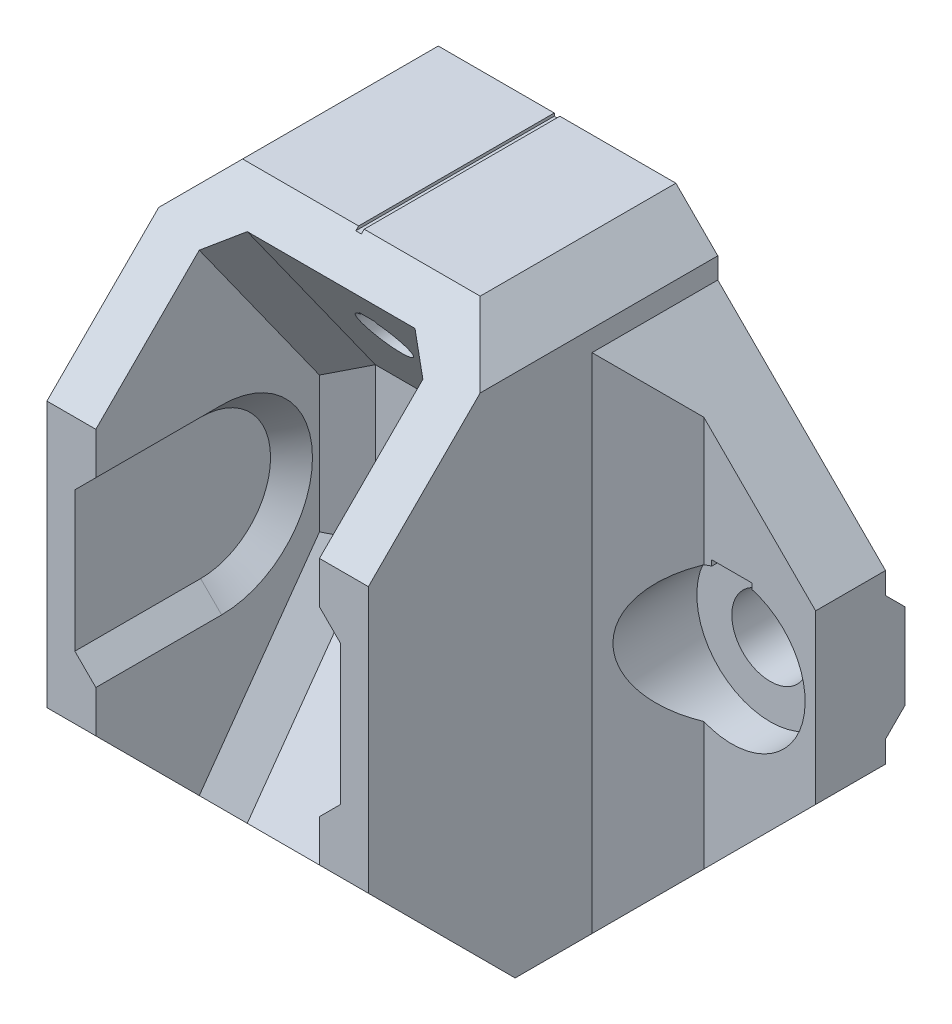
ISO-10303-21;
HEADER;
FILE_DESCRIPTION(('STEP AP214'),'2;1');
FILE_NAME('part.step','',(''),(''),'','','');
FILE_SCHEMA(('AUTOMOTIVE_DESIGN { 1 0 10303 214 1 1 1 1 }'));
ENDSEC;
DATA;
#1=APPLICATION_CONTEXT('core data for automotive mechanical design processes');
#2=APPLICATION_PROTOCOL_DEFINITION('international standard','automotive_design',2000,#1);
#3=PRODUCT_CONTEXT('',#1,'mechanical');
#4=PRODUCT('Part','Part','',(#3));
#5=PRODUCT_RELATED_PRODUCT_CATEGORY('part','',(#4));
#6=PRODUCT_DEFINITION_FORMATION('','',#4);
#7=PRODUCT_DEFINITION_CONTEXT('part definition',#1,'design');
#8=PRODUCT_DEFINITION('design','',#6,#7);
#9=PRODUCT_DEFINITION_SHAPE('','',#8);
#10=(LENGTH_UNIT() NAMED_UNIT(*) SI_UNIT(.MILLI.,.METRE.));
#11=(NAMED_UNIT(*) PLANE_ANGLE_UNIT() SI_UNIT($,.RADIAN.));
#12=(NAMED_UNIT(*) SI_UNIT($,.STERADIAN.) SOLID_ANGLE_UNIT());
#13=UNCERTAINTY_MEASURE_WITH_UNIT(LENGTH_MEASURE(1.E-05),#10,'distance_accuracy_value','');
#14=(GEOMETRIC_REPRESENTATION_CONTEXT(3) GLOBAL_UNCERTAINTY_ASSIGNED_CONTEXT((#13)) GLOBAL_UNIT_ASSIGNED_CONTEXT((#10,
#11,#12)) REPRESENTATION_CONTEXT('',''));
#15=CARTESIAN_POINT('',(0.,0.,0.));
#16=DIRECTION('',(0.,0.,1.));
#17=DIRECTION('',(1.,0.,0.));
#18=AXIS2_PLACEMENT_3D('',#15,#16,#17);
#19=CARTESIAN_POINT('',(-23.5,4.,-2.));
#20=DIRECTION('',(0.,0.,1.));
#21=DIRECTION('',(1.,0.,0.));
#22=AXIS2_PLACEMENT_3D('',#19,#20,#21);
#23=PLANE('',#22);
#24=CARTESIAN_POINT('',(-17.5,-2.,-2.));
#25=DIRECTION('',(0.,0.,1.));
#26=DIRECTION('',(1.,0.,0.));
#27=AXIS2_PLACEMENT_3D('',#24,#25,#26);
#28=CIRCLE('',#27,5.24999999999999);
#29=CARTESIAN_POINT('',(-18.9352700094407,3.04999999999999,-2.00000000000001));
#30=VERTEX_POINT('',#29);
#31=CARTESIAN_POINT('',(-15.5,-6.8541219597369,-2.));
#32=VERTEX_POINT('',#31);
#33=EDGE_CURVE('E678',#30,#32,#28,.T.);
#34=ORIENTED_EDGE('',*,*,#33,.F.);
#35=DIRECTION('',(0.,1.,0.));
#36=VECTOR('',#35,1.);
#37=CARTESIAN_POINT('',(-18.9352700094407,4.,-2.));
#38=LINE('',#37,#36);
#39=CARTESIAN_POINT('',(-18.9352700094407,3.44999999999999,-2.));
#40=VERTEX_POINT('',#39);
#41=EDGE_CURVE('E587',#30,#40,#38,.T.);
#42=ORIENTED_EDGE('',*,*,#41,.T.);
#43=DIRECTION('',(-1.,0.,0.));
#44=VECTOR('',#43,1.);
#45=CARTESIAN_POINT('',(-23.5,3.44999999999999,-2.));
#46=LINE('',#45,#44);
#47=CARTESIAN_POINT('',(-16.0647299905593,3.44999999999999,-2.));
#48=VERTEX_POINT('',#47);
#49=EDGE_CURVE('E1171',#48,#40,#46,.T.);
#50=ORIENTED_EDGE('',*,*,#49,.F.);
#51=DIRECTION('',(0.,1.,0.));
#52=VECTOR('',#51,1.);
#53=CARTESIAN_POINT('',(-16.0647299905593,4.,-2.));
#54=LINE('',#53,#52);
#55=CARTESIAN_POINT('',(-16.0647299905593,3.04999999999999,-2.00000000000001));
#56=VERTEX_POINT('',#55);
#57=EDGE_CURVE('E584',#56,#48,#54,.T.);
#58=ORIENTED_EDGE('',*,*,#57,.F.);
#59=CARTESIAN_POINT('',(-15.5,2.8541219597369,-2.));
#60=VERTEX_POINT('',#59);
#61=EDGE_CURVE('E679',#60,#56,#28,.T.);
#62=ORIENTED_EDGE('',*,*,#61,.F.);
#63=DIRECTION('',(0.,1.,0.));
#64=VECTOR('',#63,1.);
#65=CARTESIAN_POINT('',(-15.5,4.,-2.));
#66=LINE('',#65,#64);
#67=CARTESIAN_POINT('',(-15.5,12.,-2.));
#68=VERTEX_POINT('',#67);
#69=EDGE_CURVE('E1033',#60,#68,#66,.T.);
#70=ORIENTED_EDGE('',*,*,#69,.T.);
#71=DIRECTION('',(-0.707106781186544,-0.707106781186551,0.));
#72=VECTOR('',#71,1.);
#73=CARTESIAN_POINT('',(-11.5,16.0000000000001,-2.));
#74=LINE('',#73,#72);
#75=CARTESIAN_POINT('',(-23.5,4.,-2.));
#76=VERTEX_POINT('',#75);
#77=EDGE_CURVE('E1018',#68,#76,#74,.T.);
#78=ORIENTED_EDGE('',*,*,#77,.T.);
#79=DIRECTION('',(0.,-1.,0.));
#80=VECTOR('',#79,1.);
#81=CARTESIAN_POINT('',(-23.5,4.,-2.));
#82=LINE('',#81,#80);
#83=CARTESIAN_POINT('',(-23.5,-8.,-2.));
#84=VERTEX_POINT('',#83);
#85=EDGE_CURVE('E698',#76,#84,#82,.T.);
#86=ORIENTED_EDGE('',*,*,#85,.T.);
#87=DIRECTION('',(0.707106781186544,-0.707106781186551,0.));
#88=VECTOR('',#87,1.);
#89=CARTESIAN_POINT('',(-11.5,-20.0000000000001,-2.));
#90=LINE('',#89,#88);
#91=CARTESIAN_POINT('',(-15.5,-16.,-2.));
#92=VERTEX_POINT('',#91);
#93=EDGE_CURVE('E1015',#84,#92,#90,.T.);
#94=ORIENTED_EDGE('',*,*,#93,.T.);
#95=DIRECTION('',(0.,1.,0.));
#96=VECTOR('',#95,1.);
#97=CARTESIAN_POINT('',(-15.5,4.,-2.));
#98=LINE('',#97,#96);
#99=EDGE_CURVE('E1035',#92,#32,#98,.T.);
#100=ORIENTED_EDGE('',*,*,#99,.T.);
#101=EDGE_LOOP('',(#34,#42,#50,#58,#62,#70,#78,#86,#94,#100));
#102=FACE_BOUND('',#101,.T.);
#103=ADVANCED_FACE('F41',(#102),#23,.T.);
#104=CARTESIAN_POINT('',(-17.5,-2.,-2.));
#105=DIRECTION('',(0.,0.,1.));
#106=DIRECTION('',(1.,0.,0.));
#107=AXIS2_PLACEMENT_3D('',#104,#105,#106);
#108=CYLINDRICAL_SURFACE('',#107,5.25);
#109=DIRECTION('',(0.,0.,1.));
#110=VECTOR('',#109,1.);
#111=CARTESIAN_POINT('',(-18.9352700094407,3.04999999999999,-2.));
#112=LINE('',#111,#110);
#113=CARTESIAN_POINT('',(-18.9352700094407,3.04999999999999,-4.75));
#114=VERTEX_POINT('',#113);
#115=EDGE_CURVE('E1169',#30,#114,#112,.F.);
#116=ORIENTED_EDGE('',*,*,#115,.F.);
#117=ORIENTED_EDGE('',*,*,#33,.T.);
#118=CARTESIAN_POINT('',(-17.5,-2.,-4.));
#119=DIRECTION('',(0.707106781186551,0.,-0.707106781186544));
#120=DIRECTION('',(0.707106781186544,0.,0.707106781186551));
#121=AXIS2_PLACEMENT_3D('',#118,#119,#120);
#122=ELLIPSE('',#121,7.42462120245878,5.25);
#123=EDGE_CURVE('E1047',#32,#60,#122,.F.);
#124=ORIENTED_EDGE('',*,*,#123,.T.);
#125=ORIENTED_EDGE('',*,*,#61,.T.);
#126=DIRECTION('',(0.,0.,1.));
#127=VECTOR('',#126,1.);
#128=CARTESIAN_POINT('',(-16.0647299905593,3.05,-2.));
#129=LINE('',#128,#127);
#130=CARTESIAN_POINT('',(-16.0647299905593,3.04999999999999,-4.75));
#131=VERTEX_POINT('',#130);
#132=EDGE_CURVE('E1166',#56,#131,#129,.F.);
#133=ORIENTED_EDGE('',*,*,#132,.T.);
#134=CARTESIAN_POINT('',(-17.5,-2.,-4.75));
#135=DIRECTION('',(0.,0.,1.));
#136=DIRECTION('',(1.,0.,0.));
#137=AXIS2_PLACEMENT_3D('',#134,#135,#136);
#138=CIRCLE('',#137,5.25);
#139=EDGE_CURVE('E682',#114,#131,#138,.T.);
#140=ORIENTED_EDGE('',*,*,#139,.F.);
#141=EDGE_LOOP('',(#116,#117,#124,#125,#133,#140));
#142=FACE_BOUND('',#141,.T.);
#143=ADVANCED_FACE('F1193',(#142),#108,.F.);
#144=CARTESIAN_POINT('',(-20.5094394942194,1.05,-8.4));
#145=DIRECTION('',(0.,0.,-1.));
#146=DIRECTION('',(-1.,0.,0.));
#147=AXIS2_PLACEMENT_3D('',#144,#145,#146);
#148=PLANE('',#147);
#149=DIRECTION('',(0.,-1.,0.));
#150=VECTOR('',#149,1.);
#151=CARTESIAN_POINT('',(-18.234846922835,0.849999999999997,-8.4));
#152=LINE('',#151,#150);
#153=CARTESIAN_POINT('',(-18.234846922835,0.849999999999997,-8.4));
#154=VERTEX_POINT('',#153);
#155=CARTESIAN_POINT('',(-18.234846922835,0.649999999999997,-8.4));
#156=VERTEX_POINT('',#155);
#157=EDGE_CURVE('E557',#154,#156,#152,.T.);
#158=ORIENTED_EDGE('',*,*,#157,.T.);
#159=CARTESIAN_POINT('',(-17.5,-2.,-8.4));
#160=DIRECTION('',(0.,0.,1.));
#161=DIRECTION('',(1.,0.,0.));
#162=AXIS2_PLACEMENT_3D('',#159,#160,#161);
#163=CIRCLE('',#162,2.75);
#164=CARTESIAN_POINT('',(-16.765153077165,0.649999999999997,-8.4));
#165=VERTEX_POINT('',#164);
#166=EDGE_CURVE('E687',#156,#165,#163,.T.);
#167=ORIENTED_EDGE('',*,*,#166,.T.);
#168=DIRECTION('',(0.,-1.,0.));
#169=VECTOR('',#168,1.);
#170=CARTESIAN_POINT('',(-16.765153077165,0.849999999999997,-8.4));
#171=LINE('',#170,#169);
#172=CARTESIAN_POINT('',(-16.765153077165,0.849999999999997,-8.4));
#173=VERTEX_POINT('',#172);
#174=EDGE_CURVE('E568',#173,#165,#171,.T.);
#175=ORIENTED_EDGE('',*,*,#174,.F.);
#176=DIRECTION('',(1.,0.,0.));
#177=VECTOR('',#176,1.);
#178=CARTESIAN_POINT('',(-18.234846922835,0.849999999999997,-8.4));
#179=LINE('',#178,#177);
#180=EDGE_CURVE('E550',#154,#173,#179,.T.);
#181=ORIENTED_EDGE('',*,*,#180,.F.);
#182=EDGE_LOOP('',(#158,#167,#175,#181));
#183=FACE_BOUND('',#182,.T.);
#184=DIRECTION('',(1.,0.,0.));
#185=VECTOR('',#184,1.);
#186=CARTESIAN_POINT('',(-20.5094394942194,-5.05,-8.4));
#187=LINE('',#186,#185);
#188=CARTESIAN_POINT('',(-23.5,-5.05,-8.4));
#189=VERTEX_POINT('',#188);
#190=CARTESIAN_POINT('',(23.5,-5.05,-8.4));
#191=VERTEX_POINT('',#190);
#192=EDGE_CURVE('E754',#189,#191,#187,.T.);
#193=ORIENTED_EDGE('',*,*,#192,.F.);
#194=DIRECTION('',(0.,1.,0.));
#195=VECTOR('',#194,1.);
#196=CARTESIAN_POINT('',(-23.5,-5.05,-8.4));
#197=LINE('',#196,#195);
#198=CARTESIAN_POINT('',(-23.5,1.05,-8.4));
#199=VERTEX_POINT('',#198);
#200=EDGE_CURVE('E710',#189,#199,#197,.T.);
#201=ORIENTED_EDGE('',*,*,#200,.T.);
#202=DIRECTION('',(1.,0.,0.));
#203=VECTOR('',#202,1.);
#204=CARTESIAN_POINT('',(-20.5094394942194,1.05,-8.4));
#205=LINE('',#204,#203);
#206=CARTESIAN_POINT('',(23.5,1.05,-8.4));
#207=VERTEX_POINT('',#206);
#208=EDGE_CURVE('E751',#199,#207,#205,.T.);
#209=ORIENTED_EDGE('',*,*,#208,.T.);
#210=DIRECTION('',(0.,1.,0.));
#211=VECTOR('',#210,1.);
#212=CARTESIAN_POINT('',(23.5,-5.05,-8.4));
#213=LINE('',#212,#211);
#214=EDGE_CURVE('E729',#191,#207,#213,.T.);
#215=ORIENTED_EDGE('',*,*,#214,.F.);
#216=EDGE_LOOP('',(#193,#201,#209,#215));
#217=FACE_BOUND('',#216,.T.);
#218=CARTESIAN_POINT('',(17.5,-2.,-8.4));
#219=DIRECTION('',(0.,0.,1.));
#220=DIRECTION('',(1.,0.,0.));
#221=AXIS2_PLACEMENT_3D('',#218,#219,#220);
#222=CIRCLE('',#221,2.75);
#223=CARTESIAN_POINT('',(16.765153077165,0.649999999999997,-8.4));
#224=VERTEX_POINT('',#223);
#225=CARTESIAN_POINT('',(18.234846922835,0.649999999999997,-8.4));
#226=VERTEX_POINT('',#225);
#227=EDGE_CURVE('E723',#224,#226,#222,.T.);
#228=ORIENTED_EDGE('',*,*,#227,.T.);
#229=DIRECTION('',(0.,-1.,0.));
#230=VECTOR('',#229,1.);
#231=CARTESIAN_POINT('',(18.234846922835,0.849999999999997,-8.4));
#232=LINE('',#231,#230);
#233=CARTESIAN_POINT('',(18.234846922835,0.849999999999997,-8.4));
#234=VERTEX_POINT('',#233);
#235=EDGE_CURVE('E590',#234,#226,#232,.T.);
#236=ORIENTED_EDGE('',*,*,#235,.F.);
#237=DIRECTION('',(-1.,0.,0.));
#238=VECTOR('',#237,1.);
#239=CARTESIAN_POINT('',(18.234846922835,0.849999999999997,-8.4));
#240=LINE('',#239,#238);
#241=CARTESIAN_POINT('',(16.765153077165,0.849999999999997,-8.4));
#242=VERTEX_POINT('',#241);
#243=EDGE_CURVE('E595',#234,#242,#240,.T.);
#244=ORIENTED_EDGE('',*,*,#243,.T.);
#245=DIRECTION('',(0.,-1.,0.));
#246=VECTOR('',#245,1.);
#247=CARTESIAN_POINT('',(16.765153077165,0.849999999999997,-8.4));
#248=LINE('',#247,#246);
#249=EDGE_CURVE('E592',#242,#224,#248,.T.);
#250=ORIENTED_EDGE('',*,*,#249,.T.);
#251=EDGE_LOOP('',(#228,#236,#244,#250));
#252=FACE_BOUND('',#251,.T.);
#253=ADVANCED_FACE('F566',(#183,#217,#252),#148,.T.);
#254=CARTESIAN_POINT('',(17.5,-2.,-2.));
#255=DIRECTION('',(0.,0.,1.));
#256=DIRECTION('',(1.,0.,0.));
#257=AXIS2_PLACEMENT_3D('',#254,#255,#256);
#258=CYLINDRICAL_SURFACE('',#257,2.75);
#259=DIRECTION('',(0.,0.,1.));
#260=VECTOR('',#259,1.);
#261=CARTESIAN_POINT('',(18.234846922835,0.649999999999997,-8.4));
#262=LINE('',#261,#260);
#263=CARTESIAN_POINT('',(18.234846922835,0.649999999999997,-4.75));
#264=VERTEX_POINT('',#263);
#265=EDGE_CURVE('E606',#226,#264,#262,.T.);
#266=ORIENTED_EDGE('',*,*,#265,.F.);
#267=ORIENTED_EDGE('',*,*,#227,.F.);
#268=DIRECTION('',(0.,0.,1.));
#269=VECTOR('',#268,1.);
#270=CARTESIAN_POINT('',(16.765153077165,0.649999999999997,-8.4));
#271=LINE('',#270,#269);
#272=CARTESIAN_POINT('',(16.765153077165,0.649999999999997,-4.75));
#273=VERTEX_POINT('',#272);
#274=EDGE_CURVE('E603',#224,#273,#271,.T.);
#275=ORIENTED_EDGE('',*,*,#274,.T.);
#276=CARTESIAN_POINT('',(17.5,-2.,-4.75));
#277=DIRECTION('',(0.,0.,1.));
#278=DIRECTION('',(1.,0.,0.));
#279=AXIS2_PLACEMENT_3D('',#276,#277,#278);
#280=CIRCLE('',#279,2.75);
#281=EDGE_CURVE('E720',#273,#264,#280,.T.);
#282=ORIENTED_EDGE('',*,*,#281,.T.);
#283=EDGE_LOOP('',(#266,#267,#275,#282));
#284=FACE_BOUND('',#283,.T.);
#285=ADVANCED_FACE('F1211',(#284),#258,.F.);
#286=CARTESIAN_POINT('',(20.25,-2.,-4.75));
#287=DIRECTION('',(0.,0.,-1.));
#288=DIRECTION('',(-1.,0.,0.));
#289=AXIS2_PLACEMENT_3D('',#286,#287,#288);
#290=PLANE('',#289);
#291=CARTESIAN_POINT('',(17.5,-2.,-4.75));
#292=DIRECTION('',(0.,0.,1.));
#293=DIRECTION('',(1.,0.,0.));
#294=AXIS2_PLACEMENT_3D('',#291,#292,#293);
#295=CIRCLE('',#294,5.25);
#296=CARTESIAN_POINT('',(16.0647299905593,3.05,-4.75));
#297=VERTEX_POINT('',#296);
#298=CARTESIAN_POINT('',(18.9352700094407,3.04999999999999,-4.75));
#299=VERTEX_POINT('',#298);
#300=EDGE_CURVE('E717',#297,#299,#295,.T.);
#301=ORIENTED_EDGE('',*,*,#300,.T.);
#302=DIRECTION('',(0.,-1.,0.));
#303=VECTOR('',#302,1.);
#304=CARTESIAN_POINT('',(18.9352700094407,3.44999999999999,-4.75));
#305=LINE('',#304,#303);
#306=CARTESIAN_POINT('',(18.9352700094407,3.44999999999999,-4.75));
#307=VERTEX_POINT('',#306);
#308=EDGE_CURVE('E608',#307,#299,#305,.T.);
#309=ORIENTED_EDGE('',*,*,#308,.F.);
#310=DIRECTION('',(-1.,0.,0.));
#311=VECTOR('',#310,1.);
#312=CARTESIAN_POINT('',(18.9352700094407,3.44999999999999,-4.75));
#313=LINE('',#312,#311);
#314=CARTESIAN_POINT('',(16.0647299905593,3.44999999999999,-4.75));
#315=VERTEX_POINT('',#314);
#316=EDGE_CURVE('E612',#307,#315,#313,.T.);
#317=ORIENTED_EDGE('',*,*,#316,.T.);
#318=DIRECTION('',(0.,-1.,0.));
#319=VECTOR('',#318,1.);
#320=CARTESIAN_POINT('',(16.0647299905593,3.44999999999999,-4.75));
#321=LINE('',#320,#319);
#322=EDGE_CURVE('E610',#315,#297,#321,.T.);
#323=ORIENTED_EDGE('',*,*,#322,.T.);
#324=EDGE_LOOP('',(#301,#309,#317,#323));
#325=FACE_BOUND('',#324,.T.);
#326=DIRECTION('',(0.,1.,0.));
#327=VECTOR('',#326,1.);
#328=CARTESIAN_POINT('',(18.234846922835,-2.,-4.75));
#329=LINE('',#328,#327);
#330=CARTESIAN_POINT('',(18.234846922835,0.849999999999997,-4.75));
#331=VERTEX_POINT('',#330);
#332=EDGE_CURVE('E1163',#264,#331,#329,.T.);
#333=ORIENTED_EDGE('',*,*,#332,.F.);
#334=ORIENTED_EDGE('',*,*,#281,.F.);
#335=DIRECTION('',(0.,1.,0.));
#336=VECTOR('',#335,1.);
#337=CARTESIAN_POINT('',(16.765153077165,-1.99999999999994,-4.75));
#338=LINE('',#337,#336);
#339=CARTESIAN_POINT('',(16.765153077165,0.849999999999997,-4.75));
#340=VERTEX_POINT('',#339);
#341=EDGE_CURVE('E1160',#273,#340,#338,.T.);
#342=ORIENTED_EDGE('',*,*,#341,.T.);
#343=DIRECTION('',(1.,0.,0.));
#344=VECTOR('',#343,1.);
#345=CARTESIAN_POINT('',(20.25,0.849999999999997,-4.75));
#346=LINE('',#345,#344);
#347=EDGE_CURVE('E1157',#340,#331,#346,.T.);
#348=ORIENTED_EDGE('',*,*,#347,.T.);
#349=EDGE_LOOP('',(#333,#334,#342,#348));
#350=FACE_BOUND('',#349,.T.);
#351=ADVANCED_FACE('F1207',(#325,#350),#290,.F.);
#352=CARTESIAN_POINT('',(-11.5,20.5,-7.));
#353=DIRECTION('',(0.,-1.,0.));
#354=DIRECTION('',(0.,0.,-1.));
#355=AXIS2_PLACEMENT_3D('',#352,#353,#354);
#356=PLANE('',#355);
#357=DIRECTION('',(-1.,0.,0.));
#358=VECTOR('',#357,1.);
#359=CARTESIAN_POINT('',(8.,20.5,6.99999999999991));
#360=LINE('',#359,#358);
#361=CARTESIAN_POINT('',(-8.49999999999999,20.5,6.99999999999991));
#362=VERTEX_POINT('',#361);
#363=CARTESIAN_POINT('',(-0.200000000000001,20.5,6.99999999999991));
#364=VERTEX_POINT('',#363);
#365=EDGE_CURVE('E1097',#362,#364,#360,.F.);
#366=ORIENTED_EDGE('',*,*,#365,.T.);
#367=DIRECTION('',(0.,0.,-1.));
#368=VECTOR('',#367,1.);
#369=CARTESIAN_POINT('',(-0.200000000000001,20.5,-7.));
#370=LINE('',#369,#368);
#371=CARTESIAN_POINT('',(-0.200000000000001,20.5,-7.));
#372=VERTEX_POINT('',#371);
#373=EDGE_CURVE('E672',#364,#372,#370,.T.);
#374=ORIENTED_EDGE('',*,*,#373,.T.);
#375=DIRECTION('',(1.,0.,0.));
#376=VECTOR('',#375,1.);
#377=CARTESIAN_POINT('',(-11.5,20.5,-7.));
#378=LINE('',#377,#376);
#379=CARTESIAN_POINT('',(-8.49999999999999,20.5,-7.));
#380=VERTEX_POINT('',#379);
#381=EDGE_CURVE('E1093',#380,#372,#378,.T.);
#382=ORIENTED_EDGE('',*,*,#381,.F.);
#383=DIRECTION('',(0.,0.,1.));
#384=VECTOR('',#383,1.);
#385=CARTESIAN_POINT('',(-8.49999999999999,20.5,-7.));
#386=LINE('',#385,#384);
#387=EDGE_CURVE('E1108',#380,#362,#386,.T.);
#388=ORIENTED_EDGE('',*,*,#387,.T.);
#389=EDGE_LOOP('',(#366,#374,#382,#388));
#390=FACE_BOUND('',#389,.T.);
#391=ADVANCED_FACE('F1210',(#390),#356,.F.);
#392=CARTESIAN_POINT('',(8.,-19.5,18.));
#393=DIRECTION('',(0.,0.,-1.));
#394=DIRECTION('',(0.,1.,0.));
#395=AXIS2_PLACEMENT_3D('',#392,#393,#394);
#396=PLANE('',#395);
#397=DIRECTION('',(0.,-1.,0.));
#398=VECTOR('',#397,1.);
#399=CARTESIAN_POINT('',(-11.5,21.5,18.));
#400=LINE('',#399,#398);
#401=CARTESIAN_POINT('',(-11.5,9.49999999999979,18.));
#402=VERTEX_POINT('',#401);
#403=CARTESIAN_POINT('',(-11.5,-9.49999999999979,18.));
#404=VERTEX_POINT('',#403);
#405=EDGE_CURVE('E977',#402,#404,#400,.T.);
#406=ORIENTED_EDGE('',*,*,#405,.T.);
#407=DIRECTION('',(1.,0.,0.));
#408=VECTOR('',#407,1.);
#409=CARTESIAN_POINT('',(8.,-9.49999999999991,18.));
#410=LINE('',#409,#408);
#411=CARTESIAN_POINT('',(-8.,-9.49999999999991,18.));
#412=VERTEX_POINT('',#411);
#413=EDGE_CURVE('E1059',#404,#412,#410,.T.);
#414=ORIENTED_EDGE('',*,*,#413,.T.);
#415=DIRECTION('',(0.,-1.,0.));
#416=VECTOR('',#415,1.);
#417=CARTESIAN_POINT('',(-8.,-19.5,18.));
#418=LINE('',#417,#416);
#419=CARTESIAN_POINT('',(-8.,-6.5,18.));
#420=VERTEX_POINT('',#419);
#421=EDGE_CURVE('E871',#420,#412,#418,.T.);
#422=ORIENTED_EDGE('',*,*,#421,.F.);
#423=DIRECTION('',(0.707106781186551,-0.707106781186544,0.));
#424=VECTOR('',#423,1.);
#425=CARTESIAN_POINT('',(6.50000000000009,-20.9999999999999,18.));
#426=LINE('',#425,#424);
#427=CARTESIAN_POINT('',(-9.5,-5.,18.));
#428=VERTEX_POINT('',#427);
#429=EDGE_CURVE('E877',#428,#420,#426,.T.);
#430=ORIENTED_EDGE('',*,*,#429,.F.);
#431=DIRECTION('',(0.,-1.,0.));
#432=VECTOR('',#431,1.);
#433=CARTESIAN_POINT('',(-9.5,0.,18.));
#434=LINE('',#433,#432);
#435=CARTESIAN_POINT('',(-9.5,5.,18.));
#436=VERTEX_POINT('',#435);
#437=EDGE_CURVE('E874',#436,#428,#434,.T.);
#438=ORIENTED_EDGE('',*,*,#437,.F.);
#439=DIRECTION('',(0.707106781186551,0.707106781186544,0.));
#440=VECTOR('',#439,1.);
#441=CARTESIAN_POINT('',(-12.9999999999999,1.50000000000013,18.));
#442=LINE('',#441,#440);
#443=CARTESIAN_POINT('',(-8.,6.5,18.));
#444=VERTEX_POINT('',#443);
#445=EDGE_CURVE('E870',#444,#436,#442,.F.);
#446=ORIENTED_EDGE('',*,*,#445,.F.);
#447=CARTESIAN_POINT('',(-8.,9.49999999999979,18.));
#448=VERTEX_POINT('',#447);
#449=EDGE_CURVE('E868',#448,#444,#418,.T.);
#450=ORIENTED_EDGE('',*,*,#449,.F.);
#451=DIRECTION('',(-1.,0.,0.));
#452=VECTOR('',#451,1.);
#453=CARTESIAN_POINT('',(8.,9.49999999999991,18.));
#454=LINE('',#453,#452);
#455=EDGE_CURVE('E1052',#448,#402,#454,.T.);
#456=ORIENTED_EDGE('',*,*,#455,.T.);
#457=EDGE_LOOP('',(#406,#414,#422,#430,#438,#446,#450,#456));
#458=FACE_BOUND('',#457,.T.);
#459=ADVANCED_FACE('F1381',(#458),#396,.F.);
#460=CARTESIAN_POINT('',(11.5,21.5,-7.));
#461=DIRECTION('',(-1.,0.,0.));
#462=DIRECTION('',(0.,0.,1.));
#463=AXIS2_PLACEMENT_3D('',#460,#461,#462);
#464=PLANE('',#463);
#465=DIRECTION('',(0.,-1.,0.));
#466=VECTOR('',#465,1.);
#467=CARTESIAN_POINT('',(11.5,21.5,-7.));
#468=LINE('',#467,#466);
#469=CARTESIAN_POINT('',(11.5,17.5,-7.));
#470=VERTEX_POINT('',#469);
#471=CARTESIAN_POINT('',(11.5,16.,-7.));
#472=VERTEX_POINT('',#471);
#473=EDGE_CURVE('E983',#470,#472,#468,.T.);
#474=ORIENTED_EDGE('',*,*,#473,.F.);
#475=DIRECTION('',(0.,0.,1.));
#476=VECTOR('',#475,1.);
#477=CARTESIAN_POINT('',(11.5,17.5,-7.));
#478=LINE('',#477,#476);
#479=CARTESIAN_POINT('',(11.5,17.5,9.9999999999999));
#480=VERTEX_POINT('',#479);
#481=EDGE_CURVE('E1100',#470,#480,#478,.T.);
#482=ORIENTED_EDGE('',*,*,#481,.T.);
#483=DIRECTION('',(0.,0.707106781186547,-0.707106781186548));
#484=VECTOR('',#483,1.);
#485=CARTESIAN_POINT('',(11.5,9.49999999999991,18.));
#486=LINE('',#485,#484);
#487=CARTESIAN_POINT('',(11.5,9.49999999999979,18.));
#488=VERTEX_POINT('',#487);
#489=EDGE_CURVE('E1076',#480,#488,#486,.F.);
#490=ORIENTED_EDGE('',*,*,#489,.T.);
#491=DIRECTION('',(0.,1.,0.));
#492=VECTOR('',#491,1.);
#493=CARTESIAN_POINT('',(11.5,21.5,18.));
#494=LINE('',#493,#492);
#495=CARTESIAN_POINT('',(11.5,-9.49999999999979,18.));
#496=VERTEX_POINT('',#495);
#497=EDGE_CURVE('E980',#496,#488,#494,.T.);
#498=ORIENTED_EDGE('',*,*,#497,.F.);
#499=DIRECTION('',(0.,0.707106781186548,0.707106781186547));
#500=VECTOR('',#499,1.);
#501=CARTESIAN_POINT('',(11.5,-9.49999999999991,18.));
#502=LINE('',#501,#500);
#503=CARTESIAN_POINT('',(11.5,-20.0000000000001,7.49999999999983));
#504=VERTEX_POINT('',#503);
#505=EDGE_CURVE('E1078',#496,#504,#502,.F.);
#506=ORIENTED_EDGE('',*,*,#505,.T.);
#507=DIRECTION('',(0.,0.,1.));
#508=VECTOR('',#507,1.);
#509=CARTESIAN_POINT('',(11.5,-20.0000000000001,-7.));
#510=LINE('',#509,#508);
#511=CARTESIAN_POINT('',(11.5,-20.,2.00000000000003));
#512=VERTEX_POINT('',#511);
#513=EDGE_CURVE('E998',#512,#504,#510,.T.);
#514=ORIENTED_EDGE('',*,*,#513,.F.);
#515=DIRECTION('',(0.,1.,0.));
#516=VECTOR('',#515,1.);
#517=CARTESIAN_POINT('',(11.5,16.,2.00000000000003));
#518=LINE('',#517,#516);
#519=CARTESIAN_POINT('',(11.5,16.,2.00000000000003));
#520=VERTEX_POINT('',#519);
#521=EDGE_CURVE('E1027',#512,#520,#518,.T.);
#522=ORIENTED_EDGE('',*,*,#521,.T.);
#523=DIRECTION('',(0.,0.,-1.));
#524=VECTOR('',#523,1.);
#525=CARTESIAN_POINT('',(11.5,16.,-7.));
#526=LINE('',#525,#524);
#527=EDGE_CURVE('E994',#520,#472,#526,.T.);
#528=ORIENTED_EDGE('',*,*,#527,.T.);
#529=EDGE_LOOP('',(#474,#482,#490,#498,#506,#514,#522,#528));
#530=FACE_BOUND('',#529,.T.);
#531=ADVANCED_FACE('F1388',(#530),#464,.F.);
#532=CARTESIAN_POINT('',(0.,0.,-7.));
#533=DIRECTION('',(0.,0.,1.));
#534=DIRECTION('',(1.,0.,0.));
#535=AXIS2_PLACEMENT_3D('',#532,#533,#534);
#536=PLANE('',#535);
#537=ORIENTED_EDGE('',*,*,#381,.T.);
#538=DIRECTION('',(0.,-1.,0.));
#539=VECTOR('',#538,1.);
#540=CARTESIAN_POINT('',(-0.199999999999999,0.,-7.));
#541=LINE('',#540,#539);
#542=CARTESIAN_POINT('',(-0.200000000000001,20.3,-7.));
#543=VERTEX_POINT('',#542);
#544=EDGE_CURVE('E675',#372,#543,#541,.T.);
#545=ORIENTED_EDGE('',*,*,#544,.T.);
#546=DIRECTION('',(1.,0.,0.));
#547=VECTOR('',#546,1.);
#548=CARTESIAN_POINT('',(0.,20.3,-7.));
#549=LINE('',#548,#547);
#550=CARTESIAN_POINT('',(0.2,20.3,-7.));
#551=VERTEX_POINT('',#550);
#552=EDGE_CURVE('E662',#543,#551,#549,.T.);
#553=ORIENTED_EDGE('',*,*,#552,.T.);
#554=DIRECTION('',(0.,1.,0.));
#555=VECTOR('',#554,1.);
#556=CARTESIAN_POINT('',(0.200000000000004,0.,-7.));
#557=LINE('',#556,#555);
#558=CARTESIAN_POINT('',(0.199999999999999,20.5,-7.));
#559=VERTEX_POINT('',#558);
#560=EDGE_CURVE('E669',#551,#559,#557,.T.);
#561=ORIENTED_EDGE('',*,*,#560,.T.);
#562=CARTESIAN_POINT('',(8.5,20.5,-7.));
#563=VERTEX_POINT('',#562);
#564=EDGE_CURVE('E989',#559,#563,#378,.T.);
#565=ORIENTED_EDGE('',*,*,#564,.T.);
#566=DIRECTION('',(-0.707106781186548,0.707106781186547,0.));
#567=VECTOR('',#566,1.);
#568=CARTESIAN_POINT('',(11.5,17.5,-7.));
#569=LINE('',#568,#567);
#570=EDGE_CURVE('E1116',#563,#470,#569,.F.);
#571=ORIENTED_EDGE('',*,*,#570,.T.);
#572=ORIENTED_EDGE('',*,*,#473,.T.);
#573=DIRECTION('',(-0.707106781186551,0.707106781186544,0.));
#574=VECTOR('',#573,1.);
#575=CARTESIAN_POINT('',(13.7499999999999,13.7500000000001,-7.));
#576=LINE('',#575,#574);
#577=CARTESIAN_POINT('',(23.5,4.,-7.));
#578=VERTEX_POINT('',#577);
#579=EDGE_CURVE('E1011',#472,#578,#576,.F.);
#580=ORIENTED_EDGE('',*,*,#579,.T.);
#581=DIRECTION('',(0.,1.,0.));
#582=VECTOR('',#581,1.);
#583=CARTESIAN_POINT('',(23.5,4.,-7.));
#584=LINE('',#583,#582);
#585=CARTESIAN_POINT('',(23.5,2.45000000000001,-7.));
#586=VERTEX_POINT('',#585);
#587=EDGE_CURVE('E735',#586,#578,#584,.T.);
#588=ORIENTED_EDGE('',*,*,#587,.F.);
#589=DIRECTION('',(1.,0.,0.));
#590=VECTOR('',#589,1.);
#591=CARTESIAN_POINT('',(-20.5094394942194,2.45000000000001,-7.));
#592=LINE('',#591,#590);
#593=CARTESIAN_POINT('',(-23.5,2.45000000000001,-7.));
#594=VERTEX_POINT('',#593);
#595=EDGE_CURVE('E750',#594,#586,#592,.T.);
#596=ORIENTED_EDGE('',*,*,#595,.F.);
#597=DIRECTION('',(0.,1.,0.));
#598=VECTOR('',#597,1.);
#599=CARTESIAN_POINT('',(-23.5,4.,-7.));
#600=LINE('',#599,#598);
#601=CARTESIAN_POINT('',(-23.5,4.,-7.));
#602=VERTEX_POINT('',#601);
#603=EDGE_CURVE('E704',#594,#602,#600,.T.);
#604=ORIENTED_EDGE('',*,*,#603,.T.);
#605=DIRECTION('',(0.707106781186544,0.707106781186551,0.));
#606=VECTOR('',#605,1.);
#607=CARTESIAN_POINT('',(-13.7500000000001,13.75,-7.));
#608=LINE('',#607,#606);
#609=CARTESIAN_POINT('',(-11.5,16.0000000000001,-7.));
#610=VERTEX_POINT('',#609);
#611=EDGE_CURVE('E1020',#602,#610,#608,.T.);
#612=ORIENTED_EDGE('',*,*,#611,.T.);
#613=DIRECTION('',(0.,1.,0.));
#614=VECTOR('',#613,1.);
#615=CARTESIAN_POINT('',(-11.5,21.5,-7.));
#616=LINE('',#615,#614);
#617=CARTESIAN_POINT('',(-11.5,17.5,-7.));
#618=VERTEX_POINT('',#617);
#619=EDGE_CURVE('E986',#610,#618,#616,.T.);
#620=ORIENTED_EDGE('',*,*,#619,.T.);
#621=DIRECTION('',(-0.707106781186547,-0.707106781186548,0.));
#622=VECTOR('',#621,1.);
#623=CARTESIAN_POINT('',(-8.49999999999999,20.5,-7.));
#624=LINE('',#623,#622);
#625=EDGE_CURVE('E1114',#618,#380,#624,.F.);
#626=ORIENTED_EDGE('',*,*,#625,.T.);
#627=EDGE_LOOP('',(#537,#545,#553,#561,#565,#571,#572,#580,#588,#596,#604,#612,#620,#626));
#628=FACE_BOUND('',#627,.T.);
#629=DIRECTION('',(-0.866025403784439,-0.499999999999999,0.));
#630=VECTOR('',#629,1.);
#631=CARTESIAN_POINT('',(2.89999999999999,11.3256842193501,-7.));
#632=LINE('',#631,#630);
#633=CARTESIAN_POINT('',(2.89999999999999,11.3256842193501,-7.));
#634=VERTEX_POINT('',#633);
#635=CARTESIAN_POINT('',(0.,9.65136843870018,-7.));
#636=VERTEX_POINT('',#635);
#637=EDGE_CURVE('E830',#634,#636,#632,.T.);
#638=ORIENTED_EDGE('',*,*,#637,.F.);
#639=DIRECTION('',(0.,-1.,0.));
#640=VECTOR('',#639,1.);
#641=CARTESIAN_POINT('',(2.89999999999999,14.6743157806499,-7.));
#642=LINE('',#641,#640);
#643=CARTESIAN_POINT('',(2.89999999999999,14.6743157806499,-7.));
#644=VERTEX_POINT('',#643);
#645=EDGE_CURVE('E753',#644,#634,#642,.T.);
#646=ORIENTED_EDGE('',*,*,#645,.F.);
#647=DIRECTION('',(0.866025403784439,-0.5,0.));
#648=VECTOR('',#647,1.);
#649=CARTESIAN_POINT('',(0.,16.3486315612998,-7.));
#650=LINE('',#649,#648);
#651=CARTESIAN_POINT('',(0.,16.3486315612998,-7.));
#652=VERTEX_POINT('',#651);
#653=EDGE_CURVE('E813',#652,#644,#650,.T.);
#654=ORIENTED_EDGE('',*,*,#653,.F.);
#655=DIRECTION('',(0.866025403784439,0.5,0.));
#656=VECTOR('',#655,1.);
#657=CARTESIAN_POINT('',(-2.9,14.6743157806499,-7.));
#658=LINE('',#657,#656);
#659=CARTESIAN_POINT('',(-2.9,14.6743157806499,-7.));
#660=VERTEX_POINT('',#659);
#661=EDGE_CURVE('E839',#660,#652,#658,.T.);
#662=ORIENTED_EDGE('',*,*,#661,.F.);
#663=DIRECTION('',(0.,1.,0.));
#664=VECTOR('',#663,1.);
#665=CARTESIAN_POINT('',(-2.9,11.3256842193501,-7.));
#666=LINE('',#665,#664);
#667=CARTESIAN_POINT('',(-2.9,11.3256842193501,-7.));
#668=VERTEX_POINT('',#667);
#669=EDGE_CURVE('E836',#668,#660,#666,.T.);
#670=ORIENTED_EDGE('',*,*,#669,.F.);
#671=DIRECTION('',(-0.866025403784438,0.5,0.));
#672=VECTOR('',#671,1.);
#673=CARTESIAN_POINT('',(0.,9.65136843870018,-7.));
#674=LINE('',#673,#672);
#675=EDGE_CURVE('E833',#636,#668,#674,.T.);
#676=ORIENTED_EDGE('',*,*,#675,.F.);
#677=EDGE_LOOP('',(#638,#646,#654,#662,#670,#676));
#678=FACE_BOUND('',#677,.T.);
#679=ADVANCED_FACE('F1300',(#628,#678),#536,.F.);
#680=CARTESIAN_POINT('',(0.,-13.,-7.));
#681=DIRECTION('',(0.,0.,-1.));
#682=DIRECTION('',(-1.,0.,0.));
#683=AXIS2_PLACEMENT_3D('',#680,#681,#682);
#684=CYLINDRICAL_SURFACE('',#683,1.7);
#685=CARTESIAN_POINT('',(0.,-13.,2.));
#686=DIRECTION('',(0.,0.,-1.));
#687=DIRECTION('',(-1.,0.,0.));
#688=AXIS2_PLACEMENT_3D('',#685,#686,#687);
#689=CIRCLE('',#688,1.7);
#690=CARTESIAN_POINT('',(-0.57445626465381,-11.4,2.));
#691=VERTEX_POINT('',#690);
#692=CARTESIAN_POINT('',(0.57445626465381,-11.4,2.));
#693=VERTEX_POINT('',#692);
#694=EDGE_CURVE('E859',#691,#693,#689,.F.);
#695=ORIENTED_EDGE('',*,*,#694,.F.);
#696=DIRECTION('',(0.,0.,1.));
#697=VECTOR('',#696,1.);
#698=CARTESIAN_POINT('',(-0.57445626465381,-11.4,-8.4));
#699=LINE('',#698,#697);
#700=CARTESIAN_POINT('',(-0.57445626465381,-11.4,4.21428571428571));
#701=VERTEX_POINT('',#700);
#702=EDGE_CURVE('E624',#691,#701,#699,.T.);
#703=ORIENTED_EDGE('',*,*,#702,.T.);
#704=CARTESIAN_POINT('',(0.,-13.,5.35714285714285));
#705=DIRECTION('',(0.,0.581238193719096,0.813733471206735));
#706=DIRECTION('',(0.,0.813733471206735,-0.581238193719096));
#707=AXIS2_PLACEMENT_3D('',#704,#705,#706);
#708=ELLIPSE('',#707,2.08913613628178,1.7);
#709=CARTESIAN_POINT('',(0.57445626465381,-11.4,4.21428571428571));
#710=VERTEX_POINT('',#709);
#711=EDGE_CURVE('E858',#701,#710,#708,.T.);
#712=ORIENTED_EDGE('',*,*,#711,.T.);
#713=DIRECTION('',(0.,0.,1.));
#714=VECTOR('',#713,1.);
#715=CARTESIAN_POINT('',(0.57445626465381,-11.4,-8.4));
#716=LINE('',#715,#714);
#717=EDGE_CURVE('E643',#693,#710,#716,.T.);
#718=ORIENTED_EDGE('',*,*,#717,.F.);
#719=EDGE_LOOP('',(#695,#703,#712,#718));
#720=FACE_BOUND('',#719,.T.);
#721=ADVANCED_FACE('F1295',(#720),#684,.F.);
#722=CARTESIAN_POINT('',(0.,13.,-7.));
#723=DIRECTION('',(0.,0.,-1.));
#724=DIRECTION('',(-1.,0.,0.));
#725=AXIS2_PLACEMENT_3D('',#722,#723,#724);
#726=CYLINDRICAL_SURFACE('',#725,1.7);
#727=CARTESIAN_POINT('',(0.,13.,2.));
#728=DIRECTION('',(0.,0.,-1.));
#729=DIRECTION('',(-1.,0.,0.));
#730=AXIS2_PLACEMENT_3D('',#727,#728,#729);
#731=CIRCLE('',#730,1.7);
#732=CARTESIAN_POINT('',(-0.574456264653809,14.6,2.));
#733=VERTEX_POINT('',#732);
#734=CARTESIAN_POINT('',(0.574456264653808,14.6,2.));
#735=VERTEX_POINT('',#734);
#736=EDGE_CURVE('E798',#733,#735,#731,.F.);
#737=ORIENTED_EDGE('',*,*,#736,.F.);
#738=DIRECTION('',(0.,0.,1.));
#739=VECTOR('',#738,1.);
#740=CARTESIAN_POINT('',(-0.574456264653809,14.6,-8.4));
#741=LINE('',#740,#739);
#742=CARTESIAN_POINT('',(-0.574456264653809,14.6,6.5));
#743=VERTEX_POINT('',#742);
#744=EDGE_CURVE('E634',#733,#743,#741,.T.);
#745=ORIENTED_EDGE('',*,*,#744,.T.);
#746=CARTESIAN_POINT('',(0.,13.,5.35714285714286));
#747=DIRECTION('',(0.,-0.581238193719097,0.813733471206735));
#748=DIRECTION('',(0.,-0.813733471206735,-0.581238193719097));
#749=AXIS2_PLACEMENT_3D('',#746,#747,#748);
#750=ELLIPSE('',#749,2.08913613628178,1.7);
#751=CARTESIAN_POINT('',(0.574456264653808,14.6,6.5));
#752=VERTEX_POINT('',#751);
#753=EDGE_CURVE('E855',#743,#752,#750,.T.);
#754=ORIENTED_EDGE('',*,*,#753,.T.);
#755=DIRECTION('',(0.,0.,1.));
#756=VECTOR('',#755,1.);
#757=CARTESIAN_POINT('',(0.574456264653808,14.6,-8.4));
#758=LINE('',#757,#756);
#759=EDGE_CURVE('E632',#735,#752,#758,.T.);
#760=ORIENTED_EDGE('',*,*,#759,.F.);
#761=EDGE_LOOP('',(#737,#745,#754,#760));
#762=FACE_BOUND('',#761,.T.);
#763=ADVANCED_FACE('F1291',(#762),#726,.F.);
#764=CARTESIAN_POINT('',(-6.00000000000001,-5.5,0.));
#765=DIRECTION('',(-0.70710678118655,-0.410997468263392,-0.575396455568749));
#766=DIRECTION('',(0.,-0.813733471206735,0.581238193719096));
#767=AXIS2_PLACEMENT_3D('',#764,#765,#766);
#768=PLANE('',#767);
#769=DIRECTION('',(0.,-0.813733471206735,0.581238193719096));
#770=VECTOR('',#769,1.);
#771=CARTESIAN_POINT('',(-8.,-18.3375236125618,11.6274669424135));
#772=LINE('',#771,#770);
#773=CARTESIAN_POINT('',(-8.,-4.85906989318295,2.00000000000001));
#774=VERTEX_POINT('',#773);
#775=CARTESIAN_POINT('',(-8.,-16.8996124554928,10.6003875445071));
#776=VERTEX_POINT('',#775);
#777=EDGE_CURVE('E910',#774,#776,#772,.T.);
#778=ORIENTED_EDGE('',*,*,#777,.T.);
#779=DIRECTION('',(-0.702246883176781,0.503413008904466,0.503413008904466));
#780=VECTOR('',#779,1.);
#781=CARTESIAN_POINT('',(-5.34141423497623,-18.8054474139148,8.69455258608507));
#782=LINE('',#781,#780);
#783=CARTESIAN_POINT('',(-6.00000000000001,-18.3333333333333,9.16666666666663));
#784=VERTEX_POINT('',#783);
#785=EDGE_CURVE('E1066',#776,#784,#782,.F.);
#786=ORIENTED_EDGE('',*,*,#785,.T.);
#787=DIRECTION('',(0.,0.813733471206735,-0.581238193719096));
#788=VECTOR('',#787,1.);
#789=CARTESIAN_POINT('',(-6.00000000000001,-5.5,0.));
#790=LINE('',#789,#788);
#791=CARTESIAN_POINT('',(-6.00000000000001,-5.5,0.));
#792=VERTEX_POINT('',#791);
#793=EDGE_CURVE('E905',#784,#792,#790,.T.);
#794=ORIENTED_EDGE('',*,*,#793,.T.);
#795=DIRECTION('',(-0.689622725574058,0.220999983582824,0.689622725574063));
#796=VECTOR('',#795,1.);
#797=CARTESIAN_POINT('',(-7.67647272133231,-4.96274907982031,1.67647272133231));
#798=LINE('',#797,#796);
#799=EDGE_CURVE('E969',#774,#792,#798,.F.);
#800=ORIENTED_EDGE('',*,*,#799,.F.);
#801=EDGE_LOOP('',(#778,#786,#794,#800));
#802=FACE_BOUND('',#801,.T.);
#803=ADVANCED_FACE('F1294',(#802),#768,.F.);
#804=CARTESIAN_POINT('',(-8.,0.,0.));
#805=DIRECTION('',(-1.,0.,0.));
#806=DIRECTION('',(0.,0.,1.));
#807=AXIS2_PLACEMENT_3D('',#804,#805,#806);
#808=PLANE('',#807);
#809=ORIENTED_EDGE('',*,*,#421,.T.);
#810=DIRECTION('',(0.,0.707106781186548,0.707106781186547));
#811=VECTOR('',#810,1.);
#812=CARTESIAN_POINT('',(-8.,-9.49999999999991,18.));
#813=LINE('',#812,#811);
#814=EDGE_CURVE('E1064',#412,#776,#813,.F.);
#815=ORIENTED_EDGE('',*,*,#814,.T.);
#816=ORIENTED_EDGE('',*,*,#777,.F.);
#817=DIRECTION('',(0.,-1.,0.));
#818=VECTOR('',#817,1.);
#819=CARTESIAN_POINT('',(-8.,-5.5,2.00000000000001));
#820=LINE('',#819,#818);
#821=CARTESIAN_POINT('',(-8.,4.85906989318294,2.00000000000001));
#822=VERTEX_POINT('',#821);
#823=EDGE_CURVE('E913',#822,#774,#820,.T.);
#824=ORIENTED_EDGE('',*,*,#823,.F.);
#825=DIRECTION('',(0.,-0.813733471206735,-0.581238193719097));
#826=VECTOR('',#825,1.);
#827=CARTESIAN_POINT('',(-8.,4.3375236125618,1.62746694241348));
#828=LINE('',#827,#826);
#829=CARTESIAN_POINT('',(-8.,16.8996124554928,10.6003875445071));
#830=VERTEX_POINT('',#829);
#831=EDGE_CURVE('E916',#830,#822,#828,.T.);
#832=ORIENTED_EDGE('',*,*,#831,.F.);
#833=DIRECTION('',(0.,0.707106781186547,-0.707106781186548));
#834=VECTOR('',#833,1.);
#835=CARTESIAN_POINT('',(-8.,9.49999999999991,18.));
#836=LINE('',#835,#834);
#837=EDGE_CURVE('E1062',#830,#448,#836,.F.);
#838=ORIENTED_EDGE('',*,*,#837,.T.);
#839=ORIENTED_EDGE('',*,*,#449,.T.);
#840=DIRECTION('',(0.,0.,1.));
#841=VECTOR('',#840,1.);
#842=CARTESIAN_POINT('',(-8.,6.5,18.));
#843=LINE('',#842,#841);
#844=CARTESIAN_POINT('',(-8.,6.5,9.));
#845=VERTEX_POINT('',#844);
#846=EDGE_CURVE('E932',#845,#444,#843,.T.);
#847=ORIENTED_EDGE('',*,*,#846,.F.);
#848=CARTESIAN_POINT('',(-8.,0.,9.));
#849=DIRECTION('',(-1.,0.,0.));
#850=DIRECTION('',(0.,0.,1.));
#851=AXIS2_PLACEMENT_3D('',#848,#849,#850);
#852=CIRCLE('',#851,6.5);
#853=CARTESIAN_POINT('',(-8.,-6.5,9.));
#854=VERTEX_POINT('',#853);
#855=EDGE_CURVE('E929',#854,#845,#852,.F.);
#856=ORIENTED_EDGE('',*,*,#855,.F.);
#857=DIRECTION('',(0.,0.,-1.));
#858=VECTOR('',#857,1.);
#859=CARTESIAN_POINT('',(-8.,-6.5,0.));
#860=LINE('',#859,#858);
#861=EDGE_CURVE('E926',#420,#854,#860,.T.);
#862=ORIENTED_EDGE('',*,*,#861,.F.);
#863=EDGE_LOOP('',(#809,#815,#816,#824,#832,#838,#839,#847,#856,#862));
#864=FACE_BOUND('',#863,.T.);
#865=ADVANCED_FACE('F1306',(#864),#808,.F.);
#866=CARTESIAN_POINT('',(8.,-5.5,0.));
#867=DIRECTION('',(0.,0.581238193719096,0.813733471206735));
#868=DIRECTION('',(0.,-0.813733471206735,0.581238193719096));
#869=AXIS2_PLACEMENT_3D('',#866,#867,#868);
#870=PLANE('',#869);
#871=DIRECTION('',(0.,-0.813733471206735,0.581238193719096));
#872=VECTOR('',#871,1.);
#873=CARTESIAN_POINT('',(-0.57445626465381,-5.5,0.));
#874=LINE('',#873,#872);
#875=CARTESIAN_POINT('',(-0.57445626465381,-11.2,4.07142857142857));
#876=VERTEX_POINT('',#875);
#877=EDGE_CURVE('E650',#876,#701,#874,.T.);
#878=ORIENTED_EDGE('',*,*,#877,.F.);
#879=DIRECTION('',(-1.,0.,0.));
#880=VECTOR('',#879,1.);
#881=CARTESIAN_POINT('',(8.,-11.2,4.07142857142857));
#882=LINE('',#881,#880);
#883=CARTESIAN_POINT('',(0.574456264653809,-11.2,4.07142857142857));
#884=VERTEX_POINT('',#883);
#885=EDGE_CURVE('E648',#884,#876,#882,.T.);
#886=ORIENTED_EDGE('',*,*,#885,.F.);
#887=DIRECTION('',(0.,0.813733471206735,-0.581238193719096));
#888=VECTOR('',#887,1.);
#889=CARTESIAN_POINT('',(0.574456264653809,-5.5,0.));
#890=LINE('',#889,#888);
#891=EDGE_CURVE('E628',#710,#884,#890,.T.);
#892=ORIENTED_EDGE('',*,*,#891,.F.);
#893=ORIENTED_EDGE('',*,*,#711,.F.);
#894=EDGE_LOOP('',(#878,#886,#892,#893));
#895=FACE_BOUND('',#894,.T.);
#896=ORIENTED_EDGE('',*,*,#793,.F.);
#897=DIRECTION('',(-1.,0.,0.));
#898=VECTOR('',#897,1.);
#899=CARTESIAN_POINT('',(8.,-18.3333333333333,9.16666666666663));
#900=LINE('',#899,#898);
#901=CARTESIAN_POINT('',(5.99999999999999,-18.3333333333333,9.16666666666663));
#902=VERTEX_POINT('',#901);
#903=EDGE_CURVE('E1068',#784,#902,#900,.F.);
#904=ORIENTED_EDGE('',*,*,#903,.T.);
#905=DIRECTION('',(0.,-0.813733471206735,0.581238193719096));
#906=VECTOR('',#905,1.);
#907=CARTESIAN_POINT('',(5.99999999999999,-5.5,0.));
#908=LINE('',#907,#906);
#909=CARTESIAN_POINT('',(5.99999999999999,-5.5,0.));
#910=VERTEX_POINT('',#909);
#911=EDGE_CURVE('E907',#910,#902,#908,.T.);
#912=ORIENTED_EDGE('',*,*,#911,.F.);
#913=DIRECTION('',(-1.,0.,0.));
#914=VECTOR('',#913,1.);
#915=CARTESIAN_POINT('',(8.,-5.5,0.));
#916=LINE('',#915,#914);
#917=EDGE_CURVE('E935',#910,#792,#916,.T.);
#918=ORIENTED_EDGE('',*,*,#917,.T.);
#919=EDGE_LOOP('',(#896,#904,#912,#918));
#920=FACE_BOUND('',#919,.T.);
#921=ADVANCED_FACE('F1302',(#895,#920),#870,.T.);
#922=CARTESIAN_POINT('',(8.,0.,0.));
#923=DIRECTION('',(-1.,0.,0.));
#924=DIRECTION('',(0.,0.,1.));
#925=AXIS2_PLACEMENT_3D('',#922,#923,#924);
#926=PLANE('',#925);
#927=DIRECTION('',(0.,0.813733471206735,-0.581238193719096));
#928=VECTOR('',#927,1.);
#929=CARTESIAN_POINT('',(8.,-0.695631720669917,-0.973884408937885));
#930=LINE('',#929,#928);
#931=CARTESIAN_POINT('',(8.,-16.8996124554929,10.6003875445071));
#932=VERTEX_POINT('',#931);
#933=CARTESIAN_POINT('',(8.,-4.85906989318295,1.99999999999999));
#934=VERTEX_POINT('',#933);
#935=EDGE_CURVE('E886',#932,#934,#930,.T.);
#936=ORIENTED_EDGE('',*,*,#935,.F.);
#937=DIRECTION('',(0.,-0.707106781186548,-0.707106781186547));
#938=VECTOR('',#937,1.);
#939=CARTESIAN_POINT('',(8.,-13.75,13.75));
#940=LINE('',#939,#938);
#941=CARTESIAN_POINT('',(8.,-9.49999999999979,18.));
#942=VERTEX_POINT('',#941);
#943=EDGE_CURVE('E1074',#932,#942,#940,.F.);
#944=ORIENTED_EDGE('',*,*,#943,.T.);
#945=DIRECTION('',(0.,-1.,0.));
#946=VECTOR('',#945,1.);
#947=CARTESIAN_POINT('',(8.,0.,18.));
#948=LINE('',#947,#946);
#949=CARTESIAN_POINT('',(8.,-6.5,18.));
#950=VERTEX_POINT('',#949);
#951=EDGE_CURVE('E883',#950,#942,#948,.T.);
#952=ORIENTED_EDGE('',*,*,#951,.F.);
#953=DIRECTION('',(0.,0.,1.));
#954=VECTOR('',#953,1.);
#955=CARTESIAN_POINT('',(8.,-6.5,18.));
#956=LINE('',#955,#954);
#957=CARTESIAN_POINT('',(8.,-6.5,9.));
#958=VERTEX_POINT('',#957);
#959=EDGE_CURVE('E924',#958,#950,#956,.T.);
#960=ORIENTED_EDGE('',*,*,#959,.F.);
#961=CARTESIAN_POINT('',(8.,0.,9.));
#962=DIRECTION('',(-1.,0.,0.));
#963=DIRECTION('',(0.,0.,1.));
#964=AXIS2_PLACEMENT_3D('',#961,#962,#963);
#965=CIRCLE('',#964,6.5);
#966=CARTESIAN_POINT('',(8.,6.5,9.));
#967=VERTEX_POINT('',#966);
#968=EDGE_CURVE('E921',#967,#958,#965,.T.);
#969=ORIENTED_EDGE('',*,*,#968,.F.);
#970=DIRECTION('',(0.,0.,-1.));
#971=VECTOR('',#970,1.);
#972=CARTESIAN_POINT('',(8.,6.5,0.));
#973=LINE('',#972,#971);
#974=CARTESIAN_POINT('',(8.,6.5,18.));
#975=VERTEX_POINT('',#974);
#976=EDGE_CURVE('E918',#975,#967,#973,.T.);
#977=ORIENTED_EDGE('',*,*,#976,.F.);
#978=CARTESIAN_POINT('',(8.,9.49999999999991,18.));
#979=VERTEX_POINT('',#978);
#980=EDGE_CURVE('E880',#979,#975,#948,.T.);
#981=ORIENTED_EDGE('',*,*,#980,.F.);
#982=DIRECTION('',(0.,-0.707106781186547,0.707106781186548));
#983=VECTOR('',#982,1.);
#984=CARTESIAN_POINT('',(8.,13.75,13.75));
#985=LINE('',#984,#983);
#986=CARTESIAN_POINT('',(8.,16.8996124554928,10.6003875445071));
#987=VERTEX_POINT('',#986);
#988=EDGE_CURVE('E1072',#979,#987,#985,.F.);
#989=ORIENTED_EDGE('',*,*,#988,.T.);
#990=DIRECTION('',(0.,0.813733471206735,0.581238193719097));
#991=VECTOR('',#990,1.);
#992=CARTESIAN_POINT('',(8.,0.695631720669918,-0.973884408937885));
#993=LINE('',#992,#991);
#994=CARTESIAN_POINT('',(8.,4.85906989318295,1.99999999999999));
#995=VERTEX_POINT('',#994);
#996=EDGE_CURVE('E891',#995,#987,#993,.T.);
#997=ORIENTED_EDGE('',*,*,#996,.F.);
#998=DIRECTION('',(0.,1.,0.));
#999=VECTOR('',#998,1.);
#1000=CARTESIAN_POINT('',(8.,0.,1.99999999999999));
#1001=LINE('',#1000,#999);
#1002=EDGE_CURVE('E888',#934,#995,#1001,.T.);
#1003=ORIENTED_EDGE('',*,*,#1002,.F.);
#1004=EDGE_LOOP('',(#936,#944,#952,#960,#969,#977,#981,#989,#997,#1003));
#1005=FACE_BOUND('',#1004,.T.);
#1006=ADVANCED_FACE('F1305',(#1005),#926,.T.);
#1007=CARTESIAN_POINT('',(8.,-0.695631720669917,-0.973884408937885));
#1008=DIRECTION('',(-0.707106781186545,0.410997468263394,0.575396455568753));
#1009=DIRECTION('',(0.,0.813733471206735,-0.581238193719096));
#1010=AXIS2_PLACEMENT_3D('',#1007,#1008,#1009);
#1011=PLANE('',#1010);
#1012=ORIENTED_EDGE('',*,*,#911,.T.);
#1013=DIRECTION('',(0.702246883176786,0.503413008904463,0.503413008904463));
#1014=VECTOR('',#1013,1.);
#1015=CARTESIAN_POINT('',(13.2318251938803,-13.149123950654,14.3508760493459));
#1016=LINE('',#1015,#1014);
#1017=EDGE_CURVE('E1070',#902,#932,#1016,.T.);
#1018=ORIENTED_EDGE('',*,*,#1017,.T.);
#1019=ORIENTED_EDGE('',*,*,#935,.T.);
#1020=DIRECTION('',(-0.689622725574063,-0.220999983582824,-0.689622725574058));
#1021=VECTOR('',#1020,1.);
#1022=CARTESIAN_POINT('',(8.74055437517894,-4.62174809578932,2.74055437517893));
#1023=LINE('',#1022,#1021);
#1024=EDGE_CURVE('E974',#910,#934,#1023,.F.);
#1025=ORIENTED_EDGE('',*,*,#1024,.F.);
#1026=EDGE_LOOP('',(#1012,#1018,#1019,#1025));
#1027=FACE_BOUND('',#1026,.T.);
#1028=ADVANCED_FACE('F1334',(#1027),#1011,.T.);
#1029=CARTESIAN_POINT('',(9.50000000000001,-5.,0.));
#1030=DIRECTION('',(0.707106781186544,-0.707106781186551,0.));
#1031=DIRECTION('',(0.,0.,1.));
#1032=AXIS2_PLACEMENT_3D('',#1029,#1030,#1031);
#1033=PLANE('',#1032);
#1034=DIRECTION('',(-0.707106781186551,-0.707106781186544,0.));
#1035=VECTOR('',#1034,1.);
#1036=CARTESIAN_POINT('',(1.5,-12.9999999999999,18.));
#1037=LINE('',#1036,#1035);
#1038=CARTESIAN_POINT('',(9.5,-5.,18.));
#1039=VERTEX_POINT('',#1038);
#1040=EDGE_CURVE('E862',#950,#1039,#1037,.F.);
#1041=ORIENTED_EDGE('',*,*,#1040,.T.);
#1042=DIRECTION('',(0.,0.,-1.));
#1043=VECTOR('',#1042,1.);
#1044=CARTESIAN_POINT('',(9.5,-5.,0.));
#1045=LINE('',#1044,#1043);
#1046=CARTESIAN_POINT('',(9.5,-5.,9.));
#1047=VERTEX_POINT('',#1046);
#1048=EDGE_CURVE('E947',#1039,#1047,#1045,.T.);
#1049=ORIENTED_EDGE('',*,*,#1048,.T.);
#1050=DIRECTION('',(-0.707106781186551,-0.707106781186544,0.));
#1051=VECTOR('',#1050,1.);
#1052=CARTESIAN_POINT('',(9.50000000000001,-5.,9.));
#1053=LINE('',#1052,#1051);
#1054=EDGE_CURVE('E963',#1047,#958,#1053,.T.);
#1055=ORIENTED_EDGE('',*,*,#1054,.T.);
#1056=ORIENTED_EDGE('',*,*,#959,.T.);
#1057=EDGE_LOOP('',(#1041,#1049,#1055,#1056));
#1058=FACE_BOUND('',#1057,.T.);
#1059=ADVANCED_FACE('F1330',(#1058),#1033,.F.);
#1060=CARTESIAN_POINT('',(9.50000000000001,0.,9.));
#1061=DIRECTION('',(-1.,0.,0.));
#1062=DIRECTION('',(0.,0.,1.));
#1063=AXIS2_PLACEMENT_3D('',#1060,#1061,#1062);
#1064=CONICAL_SURFACE('',#1063,5.,0.785398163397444);
#1065=ORIENTED_EDGE('',*,*,#1054,.F.);
#1066=CARTESIAN_POINT('',(9.5,0.,9.));
#1067=DIRECTION('',(1.,0.,0.));
#1068=DIRECTION('',(0.,0.,-1.));
#1069=AXIS2_PLACEMENT_3D('',#1066,#1067,#1068);
#1070=CIRCLE('',#1069,5.);
#1071=CARTESIAN_POINT('',(9.5,5.,9.));
#1072=VERTEX_POINT('',#1071);
#1073=EDGE_CURVE('E944',#1047,#1072,#1070,.T.);
#1074=ORIENTED_EDGE('',*,*,#1073,.T.);
#1075=DIRECTION('',(-0.707106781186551,0.707106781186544,0.));
#1076=VECTOR('',#1075,1.);
#1077=CARTESIAN_POINT('',(9.50000000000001,5.,9.));
#1078=LINE('',#1077,#1076);
#1079=EDGE_CURVE('E965',#1072,#967,#1078,.T.);
#1080=ORIENTED_EDGE('',*,*,#1079,.T.);
#1081=ORIENTED_EDGE('',*,*,#968,.T.);
#1082=EDGE_LOOP('',(#1065,#1074,#1080,#1081));
#1083=FACE_BOUND('',#1082,.T.);
#1084=ADVANCED_FACE('F1333',(#1083),#1064,.F.);
#1085=CARTESIAN_POINT('',(8.,6.5,0.));
#1086=DIRECTION('',(-0.707106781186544,-0.707106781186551,0.));
#1087=DIRECTION('',(0.,0.,-1.));
#1088=AXIS2_PLACEMENT_3D('',#1085,#1086,#1087);
#1089=PLANE('',#1088);
#1090=DIRECTION('',(-0.707106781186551,0.707106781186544,0.));
#1091=VECTOR('',#1090,1.);
#1092=CARTESIAN_POINT('',(21.,-6.49999999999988,18.));
#1093=LINE('',#1092,#1091);
#1094=CARTESIAN_POINT('',(9.5,5.,18.));
#1095=VERTEX_POINT('',#1094);
#1096=EDGE_CURVE('E865',#1095,#975,#1093,.T.);
#1097=ORIENTED_EDGE('',*,*,#1096,.T.);
#1098=ORIENTED_EDGE('',*,*,#976,.T.);
#1099=ORIENTED_EDGE('',*,*,#1079,.F.);
#1100=DIRECTION('',(0.,0.,-1.));
#1101=VECTOR('',#1100,1.);
#1102=CARTESIAN_POINT('',(9.5,5.,0.));
#1103=LINE('',#1102,#1101);
#1104=EDGE_CURVE('E941',#1095,#1072,#1103,.T.);
#1105=ORIENTED_EDGE('',*,*,#1104,.F.);
#1106=EDGE_LOOP('',(#1097,#1098,#1099,#1105));
#1107=FACE_BOUND('',#1106,.T.);
#1108=ADVANCED_FACE('F1340',(#1107),#1089,.T.);
#1109=CARTESIAN_POINT('',(8.,0.695631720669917,-0.973884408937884));
#1110=DIRECTION('',(-0.707106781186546,-0.410997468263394,0.575396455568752));
#1111=DIRECTION('',(0.,0.813733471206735,0.581238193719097));
#1112=AXIS2_PLACEMENT_3D('',#1109,#1110,#1111);
#1113=PLANE('',#1112);
#1114=ORIENTED_EDGE('',*,*,#996,.T.);
#1115=DIRECTION('',(-0.702246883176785,0.503413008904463,-0.503413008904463));
#1116=VECTOR('',#1115,1.);
#1117=CARTESIAN_POINT('',(13.2318251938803,13.149123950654,14.3508760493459));
#1118=LINE('',#1117,#1116);
#1119=CARTESIAN_POINT('',(5.99999999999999,18.3333333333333,9.16666666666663));
#1120=VERTEX_POINT('',#1119);
#1121=EDGE_CURVE('E1086',#987,#1120,#1118,.T.);
#1122=ORIENTED_EDGE('',*,*,#1121,.T.);
#1123=DIRECTION('',(0.,-0.813733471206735,-0.581238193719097));
#1124=VECTOR('',#1123,1.);
#1125=CARTESIAN_POINT('',(5.99999999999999,19.5,10.));
#1126=LINE('',#1125,#1124);
#1127=CARTESIAN_POINT('',(5.99999999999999,5.5,0.));
#1128=VERTEX_POINT('',#1127);
#1129=EDGE_CURVE('E897',#1120,#1128,#1126,.T.);
#1130=ORIENTED_EDGE('',*,*,#1129,.T.);
#1131=DIRECTION('',(-0.689622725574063,0.220999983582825,-0.689622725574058));
#1132=VECTOR('',#1131,1.);
#1133=CARTESIAN_POINT('',(7.22021703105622,5.10896308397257,1.22021703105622));
#1134=LINE('',#1133,#1132);
#1135=EDGE_CURVE('E972',#1128,#995,#1134,.F.);
#1136=ORIENTED_EDGE('',*,*,#1135,.T.);
#1137=EDGE_LOOP('',(#1114,#1122,#1130,#1136));
#1138=FACE_BOUND('',#1137,.T.);
#1139=ADVANCED_FACE('F1343',(#1138),#1113,.T.);
#1140=CARTESIAN_POINT('',(8.,0.,1.99999999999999));
#1141=DIRECTION('',(-0.707106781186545,0.,0.70710678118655));
#1142=DIRECTION('',(0.,1.,0.));
#1143=AXIS2_PLACEMENT_3D('',#1140,#1141,#1142);
#1144=PLANE('',#1143);
#1145=ORIENTED_EDGE('',*,*,#1135,.F.);
#1146=DIRECTION('',(0.,-1.,0.));
#1147=VECTOR('',#1146,1.);
#1148=CARTESIAN_POINT('',(5.99999999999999,5.5,0.));
#1149=LINE('',#1148,#1147);
#1150=EDGE_CURVE('E902',#1128,#910,#1149,.T.);
#1151=ORIENTED_EDGE('',*,*,#1150,.T.);
#1152=ORIENTED_EDGE('',*,*,#1024,.T.);
#1153=ORIENTED_EDGE('',*,*,#1002,.T.);
#1154=EDGE_LOOP('',(#1145,#1151,#1152,#1153));
#1155=FACE_BOUND('',#1154,.T.);
#1156=ADVANCED_FACE('F1338',(#1155),#1144,.T.);
#1157=CARTESIAN_POINT('',(9.5,0.,0.));
#1158=DIRECTION('',(1.,0.,0.));
#1159=DIRECTION('',(0.,0.,-1.));
#1160=AXIS2_PLACEMENT_3D('',#1157,#1158,#1159);
#1161=PLANE('',#1160);
#1162=ORIENTED_EDGE('',*,*,#1048,.F.);
#1163=DIRECTION('',(0.,-1.,0.));
#1164=VECTOR('',#1163,1.);
#1165=CARTESIAN_POINT('',(9.5,0.,18.));
#1166=LINE('',#1165,#1164);
#1167=EDGE_CURVE('E882',#1095,#1039,#1166,.T.);
#1168=ORIENTED_EDGE('',*,*,#1167,.F.);
#1169=ORIENTED_EDGE('',*,*,#1104,.T.);
#1170=ORIENTED_EDGE('',*,*,#1073,.F.);
#1171=EDGE_LOOP('',(#1162,#1168,#1169,#1170));
#1172=FACE_BOUND('',#1171,.T.);
#1173=ADVANCED_FACE('F1325',(#1172),#1161,.F.);
#1174=CARTESIAN_POINT('',(8.,19.5,10.));
#1175=DIRECTION('',(0.,-0.581238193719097,0.813733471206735));
#1176=DIRECTION('',(0.,-0.813733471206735,-0.581238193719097));
#1177=AXIS2_PLACEMENT_3D('',#1174,#1175,#1176);
#1178=PLANE('',#1177);
#1179=DIRECTION('',(0.,-0.813733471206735,-0.581238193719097));
#1180=VECTOR('',#1179,1.);
#1181=CARTESIAN_POINT('',(-0.574456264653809,19.5,10.));
#1182=LINE('',#1181,#1180);
#1183=CARTESIAN_POINT('',(-0.574456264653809,14.8,6.64285714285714));
#1184=VERTEX_POINT('',#1183);
#1185=EDGE_CURVE('E656',#1184,#743,#1182,.T.);
#1186=ORIENTED_EDGE('',*,*,#1185,.F.);
#1187=DIRECTION('',(-1.,0.,0.));
#1188=VECTOR('',#1187,1.);
#1189=CARTESIAN_POINT('',(8.,14.8,6.64285714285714));
#1190=LINE('',#1189,#1188);
#1191=CARTESIAN_POINT('',(0.574456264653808,14.8,6.64285714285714));
#1192=VERTEX_POINT('',#1191);
#1193=EDGE_CURVE('E654',#1192,#1184,#1190,.T.);
#1194=ORIENTED_EDGE('',*,*,#1193,.F.);
#1195=DIRECTION('',(0.,0.813733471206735,0.581238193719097));
#1196=VECTOR('',#1195,1.);
#1197=CARTESIAN_POINT('',(0.574456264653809,19.5,10.));
#1198=LINE('',#1197,#1196);
#1199=EDGE_CURVE('E652',#752,#1192,#1198,.T.);
#1200=ORIENTED_EDGE('',*,*,#1199,.F.);
#1201=ORIENTED_EDGE('',*,*,#753,.F.);
#1202=EDGE_LOOP('',(#1186,#1194,#1200,#1201));
#1203=FACE_BOUND('',#1202,.T.);
#1204=ORIENTED_EDGE('',*,*,#1129,.F.);
#1205=DIRECTION('',(1.,0.,0.));
#1206=VECTOR('',#1205,1.);
#1207=CARTESIAN_POINT('',(8.,18.3333333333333,9.16666666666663));
#1208=LINE('',#1207,#1206);
#1209=CARTESIAN_POINT('',(-6.00000000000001,18.3333333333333,9.16666666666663));
#1210=VERTEX_POINT('',#1209);
#1211=EDGE_CURVE('E1088',#1120,#1210,#1208,.F.);
#1212=ORIENTED_EDGE('',*,*,#1211,.T.);
#1213=DIRECTION('',(0.,0.813733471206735,0.581238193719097));
#1214=VECTOR('',#1213,1.);
#1215=CARTESIAN_POINT('',(-6.00000000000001,19.5,10.));
#1216=LINE('',#1215,#1214);
#1217=CARTESIAN_POINT('',(-6.00000000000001,5.5,0.));
#1218=VERTEX_POINT('',#1217);
#1219=EDGE_CURVE('E894',#1218,#1210,#1216,.T.);
#1220=ORIENTED_EDGE('',*,*,#1219,.F.);
#1221=DIRECTION('',(-1.,0.,0.));
#1222=VECTOR('',#1221,1.);
#1223=CARTESIAN_POINT('',(8.,5.5,0.));
#1224=LINE('',#1223,#1222);
#1225=EDGE_CURVE('E938',#1128,#1218,#1224,.T.);
#1226=ORIENTED_EDGE('',*,*,#1225,.F.);
#1227=EDGE_LOOP('',(#1204,#1212,#1220,#1226));
#1228=FACE_BOUND('',#1227,.T.);
#1229=ADVANCED_FACE('F1322',(#1203,#1228),#1178,.T.);
#1230=CARTESIAN_POINT('',(-6.00000000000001,19.5,10.));
#1231=DIRECTION('',(-0.70710678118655,0.410997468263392,-0.575396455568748));
#1232=DIRECTION('',(0.,-0.813733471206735,-0.581238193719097));
#1233=AXIS2_PLACEMENT_3D('',#1230,#1231,#1232);
#1234=PLANE('',#1233);
#1235=ORIENTED_EDGE('',*,*,#1219,.T.);
#1236=DIRECTION('',(0.70224688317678,0.503413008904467,-0.503413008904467));
#1237=VECTOR('',#1236,1.);
#1238=CARTESIAN_POINT('',(-5.34141423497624,18.8054474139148,8.69455258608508));
#1239=LINE('',#1238,#1237);
#1240=EDGE_CURVE('E1090',#1210,#830,#1239,.F.);
#1241=ORIENTED_EDGE('',*,*,#1240,.T.);
#1242=ORIENTED_EDGE('',*,*,#831,.T.);
#1243=DIRECTION('',(-0.689622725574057,-0.220999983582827,0.689622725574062));
#1244=VECTOR('',#1243,1.);
#1245=CARTESIAN_POINT('',(-8.622102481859,4.65970778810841,2.62210248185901));
#1246=LINE('',#1245,#1244);
#1247=EDGE_CURVE('E967',#822,#1218,#1246,.F.);
#1248=ORIENTED_EDGE('',*,*,#1247,.T.);
#1249=EDGE_LOOP('',(#1235,#1241,#1242,#1248));
#1250=FACE_BOUND('',#1249,.T.);
#1251=ADVANCED_FACE('F1320',(#1250),#1234,.F.);
#1252=CARTESIAN_POINT('',(-6.00000000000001,5.5,0.));
#1253=DIRECTION('',(-0.70710678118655,0.,-0.707106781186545));
#1254=DIRECTION('',(0.,-1.,0.));
#1255=AXIS2_PLACEMENT_3D('',#1252,#1253,#1254);
#1256=PLANE('',#1255);
#1257=ORIENTED_EDGE('',*,*,#1247,.F.);
#1258=ORIENTED_EDGE('',*,*,#823,.T.);
#1259=ORIENTED_EDGE('',*,*,#799,.T.);
#1260=DIRECTION('',(0.,1.,0.));
#1261=VECTOR('',#1260,1.);
#1262=CARTESIAN_POINT('',(-6.00000000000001,5.5,0.));
#1263=LINE('',#1262,#1261);
#1264=EDGE_CURVE('E899',#792,#1218,#1263,.T.);
#1265=ORIENTED_EDGE('',*,*,#1264,.T.);
#1266=EDGE_LOOP('',(#1257,#1258,#1259,#1265));
#1267=FACE_BOUND('',#1266,.T.);
#1268=ADVANCED_FACE('F1316',(#1267),#1256,.F.);
#1269=CARTESIAN_POINT('',(-9.50000000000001,5.,0.));
#1270=DIRECTION('',(-0.707106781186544,0.707106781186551,0.));
#1271=DIRECTION('',(0.,0.,1.));
#1272=AXIS2_PLACEMENT_3D('',#1269,#1270,#1271);
#1273=PLANE('',#1272);
#1274=ORIENTED_EDGE('',*,*,#445,.T.);
#1275=DIRECTION('',(0.,0.,-1.));
#1276=VECTOR('',#1275,1.);
#1277=CARTESIAN_POINT('',(-9.5,5.,0.));
#1278=LINE('',#1277,#1276);
#1279=CARTESIAN_POINT('',(-9.5,5.,9.));
#1280=VERTEX_POINT('',#1279);
#1281=EDGE_CURVE('E950',#436,#1280,#1278,.T.);
#1282=ORIENTED_EDGE('',*,*,#1281,.T.);
#1283=DIRECTION('',(0.707106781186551,0.707106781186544,0.));
#1284=VECTOR('',#1283,1.);
#1285=CARTESIAN_POINT('',(-9.50000000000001,5.,9.));
#1286=LINE('',#1285,#1284);
#1287=EDGE_CURVE('E959',#1280,#845,#1286,.T.);
#1288=ORIENTED_EDGE('',*,*,#1287,.T.);
#1289=ORIENTED_EDGE('',*,*,#846,.T.);
#1290=EDGE_LOOP('',(#1274,#1282,#1288,#1289));
#1291=FACE_BOUND('',#1290,.T.);
#1292=ADVANCED_FACE('F1319',(#1291),#1273,.F.);
#1293=CARTESIAN_POINT('',(-8.,0.,9.));
#1294=DIRECTION('',(1.,0.,0.));
#1295=DIRECTION('',(0.,0.,-1.));
#1296=AXIS2_PLACEMENT_3D('',#1293,#1294,#1295);
#1297=CONICAL_SURFACE('',#1296,6.5,0.785398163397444);
#1298=ORIENTED_EDGE('',*,*,#1287,.F.);
#1299=CARTESIAN_POINT('',(-9.5,0.,9.));
#1300=DIRECTION('',(1.,0.,0.));
#1301=DIRECTION('',(0.,0.,-1.));
#1302=AXIS2_PLACEMENT_3D('',#1299,#1300,#1301);
#1303=CIRCLE('',#1302,5.);
#1304=CARTESIAN_POINT('',(-9.5,-5.,9.));
#1305=VERTEX_POINT('',#1304);
#1306=EDGE_CURVE('E953',#1305,#1280,#1303,.T.);
#1307=ORIENTED_EDGE('',*,*,#1306,.F.);
#1308=DIRECTION('',(0.707106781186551,-0.707106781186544,0.));
#1309=VECTOR('',#1308,1.);
#1310=CARTESIAN_POINT('',(-9.50000000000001,-5.,9.));
#1311=LINE('',#1310,#1309);
#1312=EDGE_CURVE('E961',#1305,#854,#1311,.T.);
#1313=ORIENTED_EDGE('',*,*,#1312,.T.);
#1314=ORIENTED_EDGE('',*,*,#855,.T.);
#1315=EDGE_LOOP('',(#1298,#1307,#1313,#1314));
#1316=FACE_BOUND('',#1315,.T.);
#1317=ADVANCED_FACE('F1297',(#1316),#1297,.F.);
#1318=CARTESIAN_POINT('',(-8.,-6.5,0.));
#1319=DIRECTION('',(0.707106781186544,0.707106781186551,0.));
#1320=DIRECTION('',(0.,0.,-1.));
#1321=AXIS2_PLACEMENT_3D('',#1318,#1319,#1320);
#1322=PLANE('',#1321);
#1323=ORIENTED_EDGE('',*,*,#429,.T.);
#1324=ORIENTED_EDGE('',*,*,#861,.T.);
#1325=ORIENTED_EDGE('',*,*,#1312,.F.);
#1326=DIRECTION('',(0.,0.,-1.));
#1327=VECTOR('',#1326,1.);
#1328=CARTESIAN_POINT('',(-9.5,-5.,0.));
#1329=LINE('',#1328,#1327);
#1330=EDGE_CURVE('E956',#428,#1305,#1329,.T.);
#1331=ORIENTED_EDGE('',*,*,#1330,.F.);
#1332=EDGE_LOOP('',(#1323,#1324,#1325,#1331));
#1333=FACE_BOUND('',#1332,.T.);
#1334=ADVANCED_FACE('F1353',(#1333),#1322,.T.);
#1335=CARTESIAN_POINT('',(-9.5,0.,0.));
#1336=DIRECTION('',(1.,0.,0.));
#1337=DIRECTION('',(0.,0.,-1.));
#1338=AXIS2_PLACEMENT_3D('',#1335,#1336,#1337);
#1339=PLANE('',#1338);
#1340=ORIENTED_EDGE('',*,*,#1330,.T.);
#1341=ORIENTED_EDGE('',*,*,#1306,.T.);
#1342=ORIENTED_EDGE('',*,*,#1281,.F.);
#1343=ORIENTED_EDGE('',*,*,#437,.T.);
#1344=EDGE_LOOP('',(#1340,#1341,#1342,#1343));
#1345=FACE_BOUND('',#1344,.T.);
#1346=ADVANCED_FACE('F1314',(#1345),#1339,.T.);
#1347=CARTESIAN_POINT('',(8.,5.5,0.));
#1348=DIRECTION('',(0.,0.,1.));
#1349=DIRECTION('',(0.,-1.,0.));
#1350=AXIS2_PLACEMENT_3D('',#1347,#1348,#1349);
#1351=PLANE('',#1350);
#1352=ORIENTED_EDGE('',*,*,#917,.F.);
#1353=ORIENTED_EDGE('',*,*,#1150,.F.);
#1354=ORIENTED_EDGE('',*,*,#1225,.T.);
#1355=ORIENTED_EDGE('',*,*,#1264,.F.);
#1356=EDGE_LOOP('',(#1352,#1353,#1354,#1355));
#1357=FACE_BOUND('',#1356,.T.);
#1358=ADVANCED_FACE('F1311',(#1357),#1351,.T.);
#1359=DIRECTION('',(0.,1.,0.));
#1360=VECTOR('',#1359,1.);
#1361=CARTESIAN_POINT('',(-2.9,-14.6743157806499,-7.));
#1362=LINE('',#1361,#1360);
#1363=CARTESIAN_POINT('',(-2.9,-14.6743157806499,-7.));
#1364=VERTEX_POINT('',#1363);
#1365=CARTESIAN_POINT('',(-2.9,-11.3256842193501,-7.));
#1366=VERTEX_POINT('',#1365);
#1367=EDGE_CURVE('E781',#1364,#1366,#1362,.T.);
#1368=ORIENTED_EDGE('',*,*,#1367,.F.);
#1369=DIRECTION('',(-0.866025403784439,0.5,0.));
#1370=VECTOR('',#1369,1.);
#1371=CARTESIAN_POINT('',(0.,-16.3486315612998,-7.));
#1372=LINE('',#1371,#1370);
#1373=CARTESIAN_POINT('',(0.,-16.3486315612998,-7.));
#1374=VERTEX_POINT('',#1373);
#1375=EDGE_CURVE('E779',#1374,#1364,#1372,.T.);
#1376=ORIENTED_EDGE('',*,*,#1375,.F.);
#1377=DIRECTION('',(-0.866025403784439,-0.5,0.));
#1378=VECTOR('',#1377,1.);
#1379=CARTESIAN_POINT('',(2.9,-14.6743157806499,-7.));
#1380=LINE('',#1379,#1378);
#1381=CARTESIAN_POINT('',(2.9,-14.6743157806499,-7.));
#1382=VERTEX_POINT('',#1381);
#1383=EDGE_CURVE('E763',#1382,#1374,#1380,.T.);
#1384=ORIENTED_EDGE('',*,*,#1383,.F.);
#1385=DIRECTION('',(0.,-1.,0.));
#1386=VECTOR('',#1385,1.);
#1387=CARTESIAN_POINT('',(2.9,-11.3256842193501,-7.));
#1388=LINE('',#1387,#1386);
#1389=CARTESIAN_POINT('',(2.9,-11.3256842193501,-7.));
#1390=VERTEX_POINT('',#1389);
#1391=EDGE_CURVE('E791',#1390,#1382,#1388,.T.);
#1392=ORIENTED_EDGE('',*,*,#1391,.F.);
#1393=DIRECTION('',(0.866025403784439,-0.5,0.));
#1394=VECTOR('',#1393,1.);
#1395=CARTESIAN_POINT('',(0.,-9.65136843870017,-7.));
#1396=LINE('',#1395,#1394);
#1397=CARTESIAN_POINT('',(0.,-9.65136843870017,-7.));
#1398=VERTEX_POINT('',#1397);
#1399=EDGE_CURVE('E788',#1398,#1390,#1396,.T.);
#1400=ORIENTED_EDGE('',*,*,#1399,.F.);
#1401=DIRECTION('',(0.866025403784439,0.5,0.));
#1402=VECTOR('',#1401,1.);
#1403=CARTESIAN_POINT('',(-2.9,-11.3256842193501,-7.));
#1404=LINE('',#1403,#1402);
#1405=EDGE_CURVE('E785',#1366,#1398,#1404,.T.);
#1406=ORIENTED_EDGE('',*,*,#1405,.F.);
#1407=EDGE_LOOP('',(#1368,#1376,#1384,#1392,#1400,#1406));
#1408=FACE_BOUND('',#1407,.T.);
#1409=DIRECTION('',(-1.,0.,0.));
#1410=VECTOR('',#1409,1.);
#1411=CARTESIAN_POINT('',(-11.5,-20.0000000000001,-7.));
#1412=LINE('',#1411,#1410);
#1413=CARTESIAN_POINT('',(11.5,-20.0000000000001,-7.));
#1414=VERTEX_POINT('',#1413);
#1415=CARTESIAN_POINT('',(-11.5,-20.0000000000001,-7.));
#1416=VERTEX_POINT('',#1415);
#1417=EDGE_CURVE('E985',#1414,#1416,#1412,.T.);
#1418=ORIENTED_EDGE('',*,*,#1417,.T.);
#1419=DIRECTION('',(-0.707106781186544,0.707106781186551,0.));
#1420=VECTOR('',#1419,1.);
#1421=CARTESIAN_POINT('',(-15.7500000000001,-15.7499999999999,-7.));
#1422=LINE('',#1421,#1420);
#1423=CARTESIAN_POINT('',(-23.5,-8.,-7.));
#1424=VERTEX_POINT('',#1423);
#1425=EDGE_CURVE('E1013',#1416,#1424,#1422,.T.);
#1426=ORIENTED_EDGE('',*,*,#1425,.T.);
#1427=DIRECTION('',(0.,1.,0.));
#1428=VECTOR('',#1427,1.);
#1429=CARTESIAN_POINT('',(-23.5,-8.,-7.));
#1430=LINE('',#1429,#1428);
#1431=CARTESIAN_POINT('',(-23.5,-6.45000000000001,-7.));
#1432=VERTEX_POINT('',#1431);
#1433=EDGE_CURVE('E692',#1424,#1432,#1430,.T.);
#1434=ORIENTED_EDGE('',*,*,#1433,.T.);
#1435=DIRECTION('',(1.,0.,0.));
#1436=VECTOR('',#1435,1.);
#1437=CARTESIAN_POINT('',(-20.5094394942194,-6.45000000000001,-7.));
#1438=LINE('',#1437,#1436);
#1439=CARTESIAN_POINT('',(23.5,-6.45000000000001,-7.));
#1440=VERTEX_POINT('',#1439);
#1441=EDGE_CURVE('E756',#1432,#1440,#1438,.T.);
#1442=ORIENTED_EDGE('',*,*,#1441,.T.);
#1443=DIRECTION('',(0.,1.,0.));
#1444=VECTOR('',#1443,1.);
#1445=CARTESIAN_POINT('',(23.5,-8.,-7.));
#1446=LINE('',#1445,#1444);
#1447=CARTESIAN_POINT('',(23.5,-8.,-7.));
#1448=VERTEX_POINT('',#1447);
#1449=EDGE_CURVE('E747',#1448,#1440,#1446,.T.);
#1450=ORIENTED_EDGE('',*,*,#1449,.F.);
#1451=DIRECTION('',(0.707106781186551,0.707106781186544,0.));
#1452=VECTOR('',#1451,1.);
#1453=CARTESIAN_POINT('',(15.7499999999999,-15.7500000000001,-7.));
#1454=LINE('',#1453,#1452);
#1455=EDGE_CURVE('E1003',#1448,#1414,#1454,.F.);
#1456=ORIENTED_EDGE('',*,*,#1455,.T.);
#1457=EDGE_LOOP('',(#1418,#1426,#1434,#1442,#1450,#1456));
#1458=FACE_BOUND('',#1457,.T.);
#1459=ADVANCED_FACE('F1268',(#1408,#1458),#536,.F.);
#1460=CARTESIAN_POINT('',(-11.5,-20.0000000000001,-7.));
#1461=DIRECTION('',(0.,1.,0.));
#1462=DIRECTION('',(0.,0.,1.));
#1463=AXIS2_PLACEMENT_3D('',#1460,#1461,#1462);
#1464=PLANE('',#1463);
#1465=ORIENTED_EDGE('',*,*,#513,.T.);
#1466=DIRECTION('',(1.,0.,0.));
#1467=VECTOR('',#1466,1.);
#1468=CARTESIAN_POINT('',(8.,-20.0000000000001,7.49999999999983));
#1469=LINE('',#1468,#1467);
#1470=CARTESIAN_POINT('',(-11.5,-20.0000000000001,7.49999999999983));
#1471=VERTEX_POINT('',#1470);
#1472=EDGE_CURVE('E1080',#504,#1471,#1469,.F.);
#1473=ORIENTED_EDGE('',*,*,#1472,.T.);
#1474=DIRECTION('',(0.,0.,1.));
#1475=VECTOR('',#1474,1.);
#1476=CARTESIAN_POINT('',(-11.5,-20.0000000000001,-7.));
#1477=LINE('',#1476,#1475);
#1478=CARTESIAN_POINT('',(-11.5,-20.0000000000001,2.00000000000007));
#1479=VERTEX_POINT('',#1478);
#1480=EDGE_CURVE('E1096',#1479,#1471,#1477,.T.);
#1481=ORIENTED_EDGE('',*,*,#1480,.F.);
#1482=DIRECTION('',(0.,0.,-1.));
#1483=VECTOR('',#1482,1.);
#1484=CARTESIAN_POINT('',(-11.5,-20.0000000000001,-7.));
#1485=LINE('',#1484,#1483);
#1486=EDGE_CURVE('E1000',#1479,#1416,#1485,.T.);
#1487=ORIENTED_EDGE('',*,*,#1486,.T.);
#1488=ORIENTED_EDGE('',*,*,#1417,.F.);
#1489=EDGE_CURVE('E1130',#1414,#512,#510,.T.);
#1490=ORIENTED_EDGE('',*,*,#1489,.T.);
#1491=EDGE_LOOP('',(#1465,#1473,#1481,#1487,#1488,#1490));
#1492=FACE_BOUND('',#1491,.T.);
#1493=ADVANCED_FACE('F43',(#1492),#1464,.F.);
#1494=CARTESIAN_POINT('',(-11.5,21.5,-7.));
#1495=DIRECTION('',(1.,0.,0.));
#1496=DIRECTION('',(0.,0.,-1.));
#1497=AXIS2_PLACEMENT_3D('',#1494,#1495,#1496);
#1498=PLANE('',#1497);
#1499=DIRECTION('',(0.,-0.707106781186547,0.707106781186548));
#1500=VECTOR('',#1499,1.);
#1501=CARTESIAN_POINT('',(-11.5,9.49999999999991,18.));
#1502=LINE('',#1501,#1500);
#1503=CARTESIAN_POINT('',(-11.5,17.5,9.99999999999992));
#1504=VERTEX_POINT('',#1503);
#1505=EDGE_CURVE('E1081',#402,#1504,#1502,.F.);
#1506=ORIENTED_EDGE('',*,*,#1505,.T.);
#1507=DIRECTION('',(0.,0.,-1.));
#1508=VECTOR('',#1507,1.);
#1509=CARTESIAN_POINT('',(-11.5,17.5,-7.));
#1510=LINE('',#1509,#1508);
#1511=EDGE_CURVE('E1118',#1504,#618,#1510,.T.);
#1512=ORIENTED_EDGE('',*,*,#1511,.T.);
#1513=ORIENTED_EDGE('',*,*,#619,.F.);
#1514=DIRECTION('',(0.,0.,1.));
#1515=VECTOR('',#1514,1.);
#1516=CARTESIAN_POINT('',(-11.5,16.0000000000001,-7.));
#1517=LINE('',#1516,#1515);
#1518=CARTESIAN_POINT('',(-11.5,16.0000000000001,2.00000000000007));
#1519=VERTEX_POINT('',#1518);
#1520=EDGE_CURVE('E997',#610,#1519,#1517,.T.);
#1521=ORIENTED_EDGE('',*,*,#1520,.T.);
#1522=DIRECTION('',(0.,-1.,0.));
#1523=VECTOR('',#1522,1.);
#1524=CARTESIAN_POINT('',(-11.5,21.5,2.00000000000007));
#1525=LINE('',#1524,#1523);
#1526=EDGE_CURVE('E1030',#1519,#1479,#1525,.T.);
#1527=ORIENTED_EDGE('',*,*,#1526,.T.);
#1528=ORIENTED_EDGE('',*,*,#1480,.T.);
#1529=DIRECTION('',(0.,-0.707106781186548,-0.707106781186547));
#1530=VECTOR('',#1529,1.);
#1531=CARTESIAN_POINT('',(-11.5,-9.49999999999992,18.));
#1532=LINE('',#1531,#1530);
#1533=EDGE_CURVE('E1084',#1471,#404,#1532,.F.);
#1534=ORIENTED_EDGE('',*,*,#1533,.T.);
#1535=ORIENTED_EDGE('',*,*,#405,.F.);
#1536=EDGE_LOOP('',(#1506,#1512,#1513,#1521,#1527,#1528,#1534,#1535));
#1537=FACE_BOUND('',#1536,.T.);
#1538=ADVANCED_FACE('F1379',(#1537),#1498,.F.);
#1539=ORIENTED_EDGE('',*,*,#951,.T.);
#1540=DIRECTION('',(1.,0.,0.));
#1541=VECTOR('',#1540,1.);
#1542=CARTESIAN_POINT('',(8.,-9.49999999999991,18.));
#1543=LINE('',#1542,#1541);
#1544=EDGE_CURVE('E1057',#942,#496,#1543,.T.);
#1545=ORIENTED_EDGE('',*,*,#1544,.T.);
#1546=ORIENTED_EDGE('',*,*,#497,.T.);
#1547=DIRECTION('',(-1.,0.,0.));
#1548=VECTOR('',#1547,1.);
#1549=CARTESIAN_POINT('',(8.,9.49999999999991,18.));
#1550=LINE('',#1549,#1548);
#1551=EDGE_CURVE('E1054',#488,#979,#1550,.T.);
#1552=ORIENTED_EDGE('',*,*,#1551,.T.);
#1553=ORIENTED_EDGE('',*,*,#980,.T.);
#1554=ORIENTED_EDGE('',*,*,#1096,.F.);
#1555=ORIENTED_EDGE('',*,*,#1167,.T.);
#1556=ORIENTED_EDGE('',*,*,#1040,.F.);
#1557=EDGE_LOOP('',(#1539,#1545,#1546,#1552,#1553,#1554,#1555,#1556));
#1558=FACE_BOUND('',#1557,.T.);
#1559=ADVANCED_FACE('F1376',(#1558),#396,.F.);
#1560=ORIENTED_EDGE('',*,*,#564,.F.);
#1561=DIRECTION('',(0.,0.,1.));
#1562=VECTOR('',#1561,1.);
#1563=CARTESIAN_POINT('',(0.199999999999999,20.5,-7.));
#1564=LINE('',#1563,#1562);
#1565=CARTESIAN_POINT('',(0.2,20.5,6.99999999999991));
#1566=VERTEX_POINT('',#1565);
#1567=EDGE_CURVE('E666',#559,#1566,#1564,.T.);
#1568=ORIENTED_EDGE('',*,*,#1567,.T.);
#1569=CARTESIAN_POINT('',(8.49999999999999,20.5,6.99999999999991));
#1570=VERTEX_POINT('',#1569);
#1571=EDGE_CURVE('E1092',#1566,#1570,#360,.F.);
#1572=ORIENTED_EDGE('',*,*,#1571,.T.);
#1573=DIRECTION('',(0.,0.,-1.));
#1574=VECTOR('',#1573,1.);
#1575=CARTESIAN_POINT('',(8.5,20.5,-6.99999999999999));
#1576=LINE('',#1575,#1574);
#1577=EDGE_CURVE('E1111',#1570,#563,#1576,.T.);
#1578=ORIENTED_EDGE('',*,*,#1577,.T.);
#1579=EDGE_LOOP('',(#1560,#1568,#1572,#1578));
#1580=FACE_BOUND('',#1579,.T.);
#1581=ADVANCED_FACE('F1266',(#1580),#356,.F.);
#1582=CARTESIAN_POINT('',(0.,0.,2.));
#1583=DIRECTION('',(0.,0.,-1.));
#1584=DIRECTION('',(-1.,0.,0.));
#1585=AXIS2_PLACEMENT_3D('',#1582,#1583,#1584);
#1586=PLANE('',#1585);
#1587=DIRECTION('',(0.,1.,0.));
#1588=VECTOR('',#1587,1.);
#1589=CARTESIAN_POINT('',(-0.574456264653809,0.,2.));
#1590=LINE('',#1589,#1588);
#1591=CARTESIAN_POINT('',(-0.574456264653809,14.8,2.));
#1592=VERTEX_POINT('',#1591);
#1593=EDGE_CURVE('E1147',#733,#1592,#1590,.T.);
#1594=ORIENTED_EDGE('',*,*,#1593,.F.);
#1595=ORIENTED_EDGE('',*,*,#736,.T.);
#1596=DIRECTION('',(0.,-1.,0.));
#1597=VECTOR('',#1596,1.);
#1598=CARTESIAN_POINT('',(0.574456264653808,0.,2.));
#1599=LINE('',#1598,#1597);
#1600=CARTESIAN_POINT('',(0.574456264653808,14.8,2.));
#1601=VERTEX_POINT('',#1600);
#1602=EDGE_CURVE('E1142',#1601,#735,#1599,.T.);
#1603=ORIENTED_EDGE('',*,*,#1602,.F.);
#1604=DIRECTION('',(1.,0.,0.));
#1605=VECTOR('',#1604,1.);
#1606=CARTESIAN_POINT('',(0.,14.8,2.));
#1607=LINE('',#1606,#1605);
#1608=EDGE_CURVE('E1144',#1592,#1601,#1607,.T.);
#1609=ORIENTED_EDGE('',*,*,#1608,.F.);
#1610=EDGE_LOOP('',(#1594,#1595,#1603,#1609));
#1611=FACE_BOUND('',#1610,.T.);
#1612=DIRECTION('',(0.,-1.,0.));
#1613=VECTOR('',#1612,1.);
#1614=CARTESIAN_POINT('',(2.89999999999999,14.6743157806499,2.));
#1615=LINE('',#1614,#1613);
#1616=CARTESIAN_POINT('',(2.89999999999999,14.6743157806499,2.));
#1617=VERTEX_POINT('',#1616);
#1618=CARTESIAN_POINT('',(2.89999999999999,11.3256842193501,2.));
#1619=VERTEX_POINT('',#1618);
#1620=EDGE_CURVE('E809',#1617,#1619,#1615,.T.);
#1621=ORIENTED_EDGE('',*,*,#1620,.T.);
#1622=DIRECTION('',(-0.866025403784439,-0.499999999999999,0.));
#1623=VECTOR('',#1622,1.);
#1624=CARTESIAN_POINT('',(2.89999999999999,11.3256842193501,2.));
#1625=LINE('',#1624,#1623);
#1626=CARTESIAN_POINT('',(0.,9.65136843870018,2.));
#1627=VERTEX_POINT('',#1626);
#1628=EDGE_CURVE('E812',#1619,#1627,#1625,.T.);
#1629=ORIENTED_EDGE('',*,*,#1628,.T.);
#1630=DIRECTION('',(-0.866025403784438,0.5,0.));
#1631=VECTOR('',#1630,1.);
#1632=CARTESIAN_POINT('',(0.,9.65136843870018,2.));
#1633=LINE('',#1632,#1631);
#1634=CARTESIAN_POINT('',(-2.9,11.3256842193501,2.));
#1635=VERTEX_POINT('',#1634);
#1636=EDGE_CURVE('E816',#1627,#1635,#1633,.T.);
#1637=ORIENTED_EDGE('',*,*,#1636,.T.);
#1638=DIRECTION('',(0.,1.,0.));
#1639=VECTOR('',#1638,1.);
#1640=CARTESIAN_POINT('',(-2.9,11.3256842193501,2.));
#1641=LINE('',#1640,#1639);
#1642=CARTESIAN_POINT('',(-2.9,14.6743157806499,2.));
#1643=VERTEX_POINT('',#1642);
#1644=EDGE_CURVE('E819',#1635,#1643,#1641,.T.);
#1645=ORIENTED_EDGE('',*,*,#1644,.T.);
#1646=DIRECTION('',(0.866025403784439,0.5,0.));
#1647=VECTOR('',#1646,1.);
#1648=CARTESIAN_POINT('',(-2.9,14.6743157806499,2.));
#1649=LINE('',#1648,#1647);
#1650=CARTESIAN_POINT('',(0.,16.3486315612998,2.));
#1651=VERTEX_POINT('',#1650);
#1652=EDGE_CURVE('E822',#1643,#1651,#1649,.T.);
#1653=ORIENTED_EDGE('',*,*,#1652,.T.);
#1654=DIRECTION('',(0.866025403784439,-0.5,0.));
#1655=VECTOR('',#1654,1.);
#1656=CARTESIAN_POINT('',(0.,16.3486315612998,2.));
#1657=LINE('',#1656,#1655);
#1658=EDGE_CURVE('E825',#1651,#1617,#1657,.T.);
#1659=ORIENTED_EDGE('',*,*,#1658,.T.);
#1660=EDGE_LOOP('',(#1621,#1629,#1637,#1645,#1653,#1659));
#1661=FACE_BOUND('',#1660,.T.);
#1662=ADVANCED_FACE('F1262',(#1611,#1661),#1586,.T.);
#1663=CARTESIAN_POINT('',(2.89999999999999,14.6743157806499,2.));
#1664=DIRECTION('',(1.,0.,0.));
#1665=DIRECTION('',(0.,0.,-1.));
#1666=AXIS2_PLACEMENT_3D('',#1663,#1664,#1665);
#1667=PLANE('',#1666);
#1668=ORIENTED_EDGE('',*,*,#645,.T.);
#1669=DIRECTION('',(0.,0.,-1.));
#1670=VECTOR('',#1669,1.);
#1671=CARTESIAN_POINT('',(2.89999999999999,11.3256842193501,2.));
#1672=LINE('',#1671,#1670);
#1673=EDGE_CURVE('E828',#1619,#634,#1672,.T.);
#1674=ORIENTED_EDGE('',*,*,#1673,.F.);
#1675=ORIENTED_EDGE('',*,*,#1620,.F.);
#1676=DIRECTION('',(0.,0.,-1.));
#1677=VECTOR('',#1676,1.);
#1678=CARTESIAN_POINT('',(2.89999999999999,14.6743157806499,2.));
#1679=LINE('',#1678,#1677);
#1680=EDGE_CURVE('E782',#1617,#644,#1679,.T.);
#1681=ORIENTED_EDGE('',*,*,#1680,.T.);
#1682=EDGE_LOOP('',(#1668,#1674,#1675,#1681));
#1683=FACE_BOUND('',#1682,.T.);
#1684=ADVANCED_FACE('F1265',(#1683),#1667,.F.);
#1685=CARTESIAN_POINT('',(0.,16.3486315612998,2.));
#1686=DIRECTION('',(0.5,0.866025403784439,0.));
#1687=DIRECTION('',(-0.866025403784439,0.5,0.));
#1688=AXIS2_PLACEMENT_3D('',#1685,#1686,#1687);
#1689=PLANE('',#1688);
#1690=ORIENTED_EDGE('',*,*,#653,.T.);
#1691=ORIENTED_EDGE('',*,*,#1680,.F.);
#1692=ORIENTED_EDGE('',*,*,#1658,.F.);
#1693=DIRECTION('',(0.,0.,-1.));
#1694=VECTOR('',#1693,1.);
#1695=CARTESIAN_POINT('',(0.,16.3486315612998,2.));
#1696=LINE('',#1695,#1694);
#1697=EDGE_CURVE('E845',#1651,#652,#1696,.T.);
#1698=ORIENTED_EDGE('',*,*,#1697,.T.);
#1699=EDGE_LOOP('',(#1690,#1691,#1692,#1698));
#1700=FACE_BOUND('',#1699,.T.);
#1701=ADVANCED_FACE('F1269',(#1700),#1689,.F.);
#1702=CARTESIAN_POINT('',(-2.9,14.6743157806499,2.));
#1703=DIRECTION('',(-0.5,0.866025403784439,0.));
#1704=DIRECTION('',(-0.866025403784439,-0.5,0.));
#1705=AXIS2_PLACEMENT_3D('',#1702,#1703,#1704);
#1706=PLANE('',#1705);
#1707=ORIENTED_EDGE('',*,*,#661,.T.);
#1708=ORIENTED_EDGE('',*,*,#1697,.F.);
#1709=ORIENTED_EDGE('',*,*,#1652,.F.);
#1710=DIRECTION('',(0.,0.,-1.));
#1711=VECTOR('',#1710,1.);
#1712=CARTESIAN_POINT('',(-2.9,14.6743157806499,2.));
#1713=LINE('',#1712,#1711);
#1714=EDGE_CURVE('E847',#1643,#660,#1713,.T.);
#1715=ORIENTED_EDGE('',*,*,#1714,.T.);
#1716=EDGE_LOOP('',(#1707,#1708,#1709,#1715));
#1717=FACE_BOUND('',#1716,.T.);
#1718=ADVANCED_FACE('F1272',(#1717),#1706,.F.);
#1719=CARTESIAN_POINT('',(-2.9,11.3256842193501,2.));
#1720=DIRECTION('',(-1.,0.,0.));
#1721=DIRECTION('',(0.,0.,1.));
#1722=AXIS2_PLACEMENT_3D('',#1719,#1720,#1721);
#1723=PLANE('',#1722);
#1724=ORIENTED_EDGE('',*,*,#669,.T.);
#1725=ORIENTED_EDGE('',*,*,#1714,.F.);
#1726=ORIENTED_EDGE('',*,*,#1644,.F.);
#1727=DIRECTION('',(0.,0.,-1.));
#1728=VECTOR('',#1727,1.);
#1729=CARTESIAN_POINT('',(-2.9,11.3256842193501,2.));
#1730=LINE('',#1729,#1728);
#1731=EDGE_CURVE('E849',#1635,#668,#1730,.T.);
#1732=ORIENTED_EDGE('',*,*,#1731,.T.);
#1733=EDGE_LOOP('',(#1724,#1725,#1726,#1732));
#1734=FACE_BOUND('',#1733,.T.);
#1735=ADVANCED_FACE('F1276',(#1734),#1723,.F.);
#1736=CARTESIAN_POINT('',(0.,9.65136843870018,2.));
#1737=DIRECTION('',(-0.5,-0.866025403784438,0.));
#1738=DIRECTION('',(0.866025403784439,-0.5,0.));
#1739=AXIS2_PLACEMENT_3D('',#1736,#1737,#1738);
#1740=PLANE('',#1739);
#1741=ORIENTED_EDGE('',*,*,#675,.T.);
#1742=ORIENTED_EDGE('',*,*,#1731,.F.);
#1743=ORIENTED_EDGE('',*,*,#1636,.F.);
#1744=DIRECTION('',(0.,0.,-1.));
#1745=VECTOR('',#1744,1.);
#1746=CARTESIAN_POINT('',(0.,9.65136843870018,2.));
#1747=LINE('',#1746,#1745);
#1748=EDGE_CURVE('E851',#1627,#636,#1747,.T.);
#1749=ORIENTED_EDGE('',*,*,#1748,.T.);
#1750=EDGE_LOOP('',(#1741,#1742,#1743,#1749));
#1751=FACE_BOUND('',#1750,.T.);
#1752=ADVANCED_FACE('F1280',(#1751),#1740,.F.);
#1753=CARTESIAN_POINT('',(2.89999999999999,11.3256842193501,2.));
#1754=DIRECTION('',(0.499999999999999,-0.866025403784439,0.));
#1755=DIRECTION('',(0.866025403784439,0.499999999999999,0.));
#1756=AXIS2_PLACEMENT_3D('',#1753,#1754,#1755);
#1757=PLANE('',#1756);
#1758=ORIENTED_EDGE('',*,*,#637,.T.);
#1759=ORIENTED_EDGE('',*,*,#1748,.F.);
#1760=ORIENTED_EDGE('',*,*,#1628,.F.);
#1761=ORIENTED_EDGE('',*,*,#1673,.T.);
#1762=EDGE_LOOP('',(#1758,#1759,#1760,#1761));
#1763=FACE_BOUND('',#1762,.T.);
#1764=ADVANCED_FACE('F1238',(#1763),#1757,.F.);
#1765=CARTESIAN_POINT('',(0.,0.,2.));
#1766=DIRECTION('',(0.,0.,-1.));
#1767=DIRECTION('',(-1.,0.,0.));
#1768=AXIS2_PLACEMENT_3D('',#1765,#1766,#1767);
#1769=PLANE('',#1768);
#1770=DIRECTION('',(0.,1.,0.));
#1771=VECTOR('',#1770,1.);
#1772=CARTESIAN_POINT('',(-0.57445626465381,0.,2.));
#1773=LINE('',#1772,#1771);
#1774=CARTESIAN_POINT('',(-0.57445626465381,-11.2,2.));
#1775=VERTEX_POINT('',#1774);
#1776=EDGE_CURVE('E1140',#691,#1775,#1773,.T.);
#1777=ORIENTED_EDGE('',*,*,#1776,.F.);
#1778=ORIENTED_EDGE('',*,*,#694,.T.);
#1779=DIRECTION('',(0.,-1.,0.));
#1780=VECTOR('',#1779,1.);
#1781=CARTESIAN_POINT('',(0.57445626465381,0.,2.));
#1782=LINE('',#1781,#1780);
#1783=CARTESIAN_POINT('',(0.57445626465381,-11.2,2.));
#1784=VERTEX_POINT('',#1783);
#1785=EDGE_CURVE('E1127',#1784,#693,#1782,.T.);
#1786=ORIENTED_EDGE('',*,*,#1785,.F.);
#1787=DIRECTION('',(1.,0.,0.));
#1788=VECTOR('',#1787,1.);
#1789=CARTESIAN_POINT('',(0.,-11.2,2.));
#1790=LINE('',#1789,#1788);
#1791=EDGE_CURVE('E1137',#1775,#1784,#1790,.T.);
#1792=ORIENTED_EDGE('',*,*,#1791,.F.);
#1793=EDGE_LOOP('',(#1777,#1778,#1786,#1792));
#1794=FACE_BOUND('',#1793,.T.);
#1795=DIRECTION('',(-0.866025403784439,0.5,0.));
#1796=VECTOR('',#1795,1.);
#1797=CARTESIAN_POINT('',(0.,-16.3486315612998,2.));
#1798=LINE('',#1797,#1796);
#1799=CARTESIAN_POINT('',(0.,-16.3486315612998,2.));
#1800=VERTEX_POINT('',#1799);
#1801=CARTESIAN_POINT('',(-2.9,-14.6743157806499,2.));
#1802=VERTEX_POINT('',#1801);
#1803=EDGE_CURVE('E759',#1800,#1802,#1798,.T.);
#1804=ORIENTED_EDGE('',*,*,#1803,.T.);
#1805=DIRECTION('',(0.,1.,0.));
#1806=VECTOR('',#1805,1.);
#1807=CARTESIAN_POINT('',(-2.9,-14.6743157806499,2.));
#1808=LINE('',#1807,#1806);
#1809=CARTESIAN_POINT('',(-2.9,-11.3256842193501,2.));
#1810=VERTEX_POINT('',#1809);
#1811=EDGE_CURVE('E762',#1802,#1810,#1808,.T.);
#1812=ORIENTED_EDGE('',*,*,#1811,.T.);
#1813=DIRECTION('',(0.866025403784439,0.5,0.));
#1814=VECTOR('',#1813,1.);
#1815=CARTESIAN_POINT('',(-2.9,-11.3256842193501,2.));
#1816=LINE('',#1815,#1814);
#1817=CARTESIAN_POINT('',(0.,-9.65136843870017,2.));
#1818=VERTEX_POINT('',#1817);
#1819=EDGE_CURVE('E766',#1810,#1818,#1816,.T.);
#1820=ORIENTED_EDGE('',*,*,#1819,.T.);
#1821=DIRECTION('',(0.866025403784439,-0.5,0.));
#1822=VECTOR('',#1821,1.);
#1823=CARTESIAN_POINT('',(0.,-9.65136843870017,2.));
#1824=LINE('',#1823,#1822);
#1825=CARTESIAN_POINT('',(2.9,-11.3256842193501,2.));
#1826=VERTEX_POINT('',#1825);
#1827=EDGE_CURVE('E769',#1818,#1826,#1824,.T.);
#1828=ORIENTED_EDGE('',*,*,#1827,.T.);
#1829=DIRECTION('',(0.,-1.,0.));
#1830=VECTOR('',#1829,1.);
#1831=CARTESIAN_POINT('',(2.9,-11.3256842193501,2.));
#1832=LINE('',#1831,#1830);
#1833=CARTESIAN_POINT('',(2.9,-14.6743157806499,2.));
#1834=VERTEX_POINT('',#1833);
#1835=EDGE_CURVE('E772',#1826,#1834,#1832,.T.);
#1836=ORIENTED_EDGE('',*,*,#1835,.T.);
#1837=DIRECTION('',(-0.866025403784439,-0.5,0.));
#1838=VECTOR('',#1837,1.);
#1839=CARTESIAN_POINT('',(2.9,-14.6743157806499,2.));
#1840=LINE('',#1839,#1838);
#1841=EDGE_CURVE('E775',#1834,#1800,#1840,.T.);
#1842=ORIENTED_EDGE('',*,*,#1841,.T.);
#1843=EDGE_LOOP('',(#1804,#1812,#1820,#1828,#1836,#1842));
#1844=FACE_BOUND('',#1843,.T.);
#1845=ADVANCED_FACE('F1234',(#1794,#1844),#1769,.T.);
#1846=CARTESIAN_POINT('',(0.,-16.3486315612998,2.));
#1847=DIRECTION('',(-0.5,-0.866025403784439,0.));
#1848=DIRECTION('',(0.866025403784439,-0.5,0.));
#1849=AXIS2_PLACEMENT_3D('',#1846,#1847,#1848);
#1850=PLANE('',#1849);
#1851=ORIENTED_EDGE('',*,*,#1375,.T.);
#1852=DIRECTION('',(0.,0.,-1.));
#1853=VECTOR('',#1852,1.);
#1854=CARTESIAN_POINT('',(-2.9,-14.6743157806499,2.));
#1855=LINE('',#1854,#1853);
#1856=EDGE_CURVE('E778',#1802,#1364,#1855,.T.);
#1857=ORIENTED_EDGE('',*,*,#1856,.F.);
#1858=ORIENTED_EDGE('',*,*,#1803,.F.);
#1859=DIRECTION('',(0.,0.,-1.));
#1860=VECTOR('',#1859,1.);
#1861=CARTESIAN_POINT('',(0.,-16.3486315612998,2.));
#1862=LINE('',#1861,#1860);
#1863=EDGE_CURVE('E796',#1800,#1374,#1862,.T.);
#1864=ORIENTED_EDGE('',*,*,#1863,.T.);
#1865=EDGE_LOOP('',(#1851,#1857,#1858,#1864));
#1866=FACE_BOUND('',#1865,.T.);
#1867=ADVANCED_FACE('F1237',(#1866),#1850,.F.);
#1868=CARTESIAN_POINT('',(2.9,-14.6743157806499,2.));
#1869=DIRECTION('',(0.5,-0.866025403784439,0.));
#1870=DIRECTION('',(0.866025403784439,0.5,0.));
#1871=AXIS2_PLACEMENT_3D('',#1868,#1869,#1870);
#1872=PLANE('',#1871);
#1873=ORIENTED_EDGE('',*,*,#1383,.T.);
#1874=ORIENTED_EDGE('',*,*,#1863,.F.);
#1875=ORIENTED_EDGE('',*,*,#1841,.F.);
#1876=DIRECTION('',(0.,0.,-1.));
#1877=VECTOR('',#1876,1.);
#1878=CARTESIAN_POINT('',(2.9,-14.6743157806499,2.));
#1879=LINE('',#1878,#1877);
#1880=EDGE_CURVE('E799',#1834,#1382,#1879,.T.);
#1881=ORIENTED_EDGE('',*,*,#1880,.T.);
#1882=EDGE_LOOP('',(#1873,#1874,#1875,#1881));
#1883=FACE_BOUND('',#1882,.T.);
#1884=ADVANCED_FACE('F1240',(#1883),#1872,.F.);
#1885=CARTESIAN_POINT('',(2.9,-11.3256842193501,2.));
#1886=DIRECTION('',(1.,0.,0.));
#1887=DIRECTION('',(0.,0.,-1.));
#1888=AXIS2_PLACEMENT_3D('',#1885,#1886,#1887);
#1889=PLANE('',#1888);
#1890=ORIENTED_EDGE('',*,*,#1391,.T.);
#1891=ORIENTED_EDGE('',*,*,#1880,.F.);
#1892=ORIENTED_EDGE('',*,*,#1835,.F.);
#1893=DIRECTION('',(0.,0.,-1.));
#1894=VECTOR('',#1893,1.);
#1895=CARTESIAN_POINT('',(2.9,-11.3256842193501,2.));
#1896=LINE('',#1895,#1894);
#1897=EDGE_CURVE('E801',#1826,#1390,#1896,.T.);
#1898=ORIENTED_EDGE('',*,*,#1897,.T.);
#1899=EDGE_LOOP('',(#1890,#1891,#1892,#1898));
#1900=FACE_BOUND('',#1899,.T.);
#1901=ADVANCED_FACE('F1243',(#1900),#1889,.F.);
#1902=CARTESIAN_POINT('',(0.,-9.65136843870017,2.));
#1903=DIRECTION('',(0.5,0.866025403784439,0.));
#1904=DIRECTION('',(-0.866025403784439,0.5,0.));
#1905=AXIS2_PLACEMENT_3D('',#1902,#1903,#1904);
#1906=PLANE('',#1905);
#1907=ORIENTED_EDGE('',*,*,#1399,.T.);
#1908=ORIENTED_EDGE('',*,*,#1897,.F.);
#1909=ORIENTED_EDGE('',*,*,#1827,.F.);
#1910=DIRECTION('',(0.,0.,-1.));
#1911=VECTOR('',#1910,1.);
#1912=CARTESIAN_POINT('',(0.,-9.65136843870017,2.));
#1913=LINE('',#1912,#1911);
#1914=EDGE_CURVE('E803',#1818,#1398,#1913,.T.);
#1915=ORIENTED_EDGE('',*,*,#1914,.T.);
#1916=EDGE_LOOP('',(#1907,#1908,#1909,#1915));
#1917=FACE_BOUND('',#1916,.T.);
#1918=ADVANCED_FACE('F1247',(#1917),#1906,.F.);
#1919=CARTESIAN_POINT('',(-2.9,-11.3256842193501,2.));
#1920=DIRECTION('',(-0.5,0.866025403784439,0.));
#1921=DIRECTION('',(-0.866025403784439,-0.5,0.));
#1922=AXIS2_PLACEMENT_3D('',#1919,#1920,#1921);
#1923=PLANE('',#1922);
#1924=ORIENTED_EDGE('',*,*,#1405,.T.);
#1925=ORIENTED_EDGE('',*,*,#1914,.F.);
#1926=ORIENTED_EDGE('',*,*,#1819,.F.);
#1927=DIRECTION('',(0.,0.,-1.));
#1928=VECTOR('',#1927,1.);
#1929=CARTESIAN_POINT('',(-2.9,-11.3256842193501,2.));
#1930=LINE('',#1929,#1928);
#1931=EDGE_CURVE('E805',#1810,#1366,#1930,.T.);
#1932=ORIENTED_EDGE('',*,*,#1931,.T.);
#1933=EDGE_LOOP('',(#1924,#1925,#1926,#1932));
#1934=FACE_BOUND('',#1933,.T.);
#1935=ADVANCED_FACE('F1251',(#1934),#1923,.F.);
#1936=CARTESIAN_POINT('',(-2.9,-14.6743157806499,2.));
#1937=DIRECTION('',(-1.,0.,0.));
#1938=DIRECTION('',(0.,0.,1.));
#1939=AXIS2_PLACEMENT_3D('',#1936,#1937,#1938);
#1940=PLANE('',#1939);
#1941=ORIENTED_EDGE('',*,*,#1367,.T.);
#1942=ORIENTED_EDGE('',*,*,#1931,.F.);
#1943=ORIENTED_EDGE('',*,*,#1811,.F.);
#1944=ORIENTED_EDGE('',*,*,#1856,.T.);
#1945=EDGE_LOOP('',(#1941,#1942,#1943,#1944));
#1946=FACE_BOUND('',#1945,.T.);
#1947=ADVANCED_FACE('F1232',(#1946),#1940,.F.);
#1948=CARTESIAN_POINT('',(-20.5094394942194,1.05,-8.4));
#1949=DIRECTION('',(0.,0.707106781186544,-0.707106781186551));
#1950=DIRECTION('',(0.,0.707106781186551,0.707106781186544));
#1951=AXIS2_PLACEMENT_3D('',#1948,#1949,#1950);
#1952=PLANE('',#1951);
#1953=ORIENTED_EDGE('',*,*,#208,.F.);
#1954=DIRECTION('',(0.,0.707106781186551,0.707106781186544));
#1955=VECTOR('',#1954,1.);
#1956=CARTESIAN_POINT('',(-23.5,1.05,-8.4));
#1957=LINE('',#1956,#1955);
#1958=EDGE_CURVE('E707',#199,#594,#1957,.T.);
#1959=ORIENTED_EDGE('',*,*,#1958,.T.);
#1960=ORIENTED_EDGE('',*,*,#595,.T.);
#1961=DIRECTION('',(0.,0.707106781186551,0.707106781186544));
#1962=VECTOR('',#1961,1.);
#1963=CARTESIAN_POINT('',(23.5,1.05,-8.4));
#1964=LINE('',#1963,#1962);
#1965=EDGE_CURVE('E732',#207,#586,#1964,.T.);
#1966=ORIENTED_EDGE('',*,*,#1965,.F.);
#1967=EDGE_LOOP('',(#1953,#1959,#1960,#1966));
#1968=FACE_BOUND('',#1967,.T.);
#1969=ADVANCED_FACE('F1228',(#1968),#1952,.T.);
#1970=CARTESIAN_POINT('',(-20.5094394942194,-6.45000000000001,-7.));
#1971=DIRECTION('',(0.,-0.707106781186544,-0.707106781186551));
#1972=DIRECTION('',(0.,0.707106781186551,-0.707106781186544));
#1973=AXIS2_PLACEMENT_3D('',#1970,#1971,#1972);
#1974=PLANE('',#1973);
#1975=ORIENTED_EDGE('',*,*,#1441,.F.);
#1976=DIRECTION('',(0.,0.707106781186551,-0.707106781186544));
#1977=VECTOR('',#1976,1.);
#1978=CARTESIAN_POINT('',(-23.5,-6.45000000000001,-7.));
#1979=LINE('',#1978,#1977);
#1980=EDGE_CURVE('E689',#1432,#189,#1979,.T.);
#1981=ORIENTED_EDGE('',*,*,#1980,.T.);
#1982=ORIENTED_EDGE('',*,*,#192,.T.);
#1983=DIRECTION('',(0.,0.707106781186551,-0.707106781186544));
#1984=VECTOR('',#1983,1.);
#1985=CARTESIAN_POINT('',(23.5,-6.45000000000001,-7.));
#1986=LINE('',#1985,#1984);
#1987=EDGE_CURVE('E726',#1440,#191,#1986,.T.);
#1988=ORIENTED_EDGE('',*,*,#1987,.F.);
#1989=EDGE_LOOP('',(#1975,#1981,#1982,#1988));
#1990=FACE_BOUND('',#1989,.T.);
#1991=ADVANCED_FACE('F1222',(#1990),#1974,.T.);
#1992=CARTESIAN_POINT('',(23.5,4.,-2.));
#1993=DIRECTION('',(0.,0.,-1.));
#1994=DIRECTION('',(-1.,0.,0.));
#1995=AXIS2_PLACEMENT_3D('',#1992,#1993,#1994);
#1996=PLANE('',#1995);
#1997=DIRECTION('',(-1.,0.,0.));
#1998=VECTOR('',#1997,1.);
#1999=CARTESIAN_POINT('',(23.5,3.44999999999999,-2.));
#2000=LINE('',#1999,#1998);
#2001=CARTESIAN_POINT('',(18.9352700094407,3.44999999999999,-2.));
#2002=VERTEX_POINT('',#2001);
#2003=CARTESIAN_POINT('',(16.0647299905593,3.44999999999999,-2.));
#2004=VERTEX_POINT('',#2003);
#2005=EDGE_CURVE('E1155',#2002,#2004,#2000,.T.);
#2006=ORIENTED_EDGE('',*,*,#2005,.F.);
#2007=DIRECTION('',(0.,-1.,0.));
#2008=VECTOR('',#2007,1.);
#2009=CARTESIAN_POINT('',(18.9352700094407,4.,-2.));
#2010=LINE('',#2009,#2008);
#2011=CARTESIAN_POINT('',(18.9352700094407,3.04999999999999,-2.00000000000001));
#2012=VERTEX_POINT('',#2011);
#2013=EDGE_CURVE('E621',#2002,#2012,#2010,.T.);
#2014=ORIENTED_EDGE('',*,*,#2013,.T.);
#2015=CARTESIAN_POINT('',(17.5,-2.,-2.));
#2016=DIRECTION('',(0.,0.,1.));
#2017=DIRECTION('',(1.,0.,0.));
#2018=AXIS2_PLACEMENT_3D('',#2015,#2016,#2017);
#2019=CIRCLE('',#2018,5.24999999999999);
#2020=CARTESIAN_POINT('',(15.5000000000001,-6.85412195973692,-2.));
#2021=VERTEX_POINT('',#2020);
#2022=EDGE_CURVE('E714',#2021,#2012,#2019,.T.);
#2023=ORIENTED_EDGE('',*,*,#2022,.F.);
#2024=DIRECTION('',(0.,-1.,0.));
#2025=VECTOR('',#2024,1.);
#2026=CARTESIAN_POINT('',(15.5000000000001,-20.,-2.));
#2027=LINE('',#2026,#2025);
#2028=CARTESIAN_POINT('',(15.5000000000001,-15.9999999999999,-2.));
#2029=VERTEX_POINT('',#2028);
#2030=EDGE_CURVE('E1022',#2021,#2029,#2027,.T.);
#2031=ORIENTED_EDGE('',*,*,#2030,.T.);
#2032=DIRECTION('',(-0.707106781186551,-0.707106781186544,0.));
#2033=VECTOR('',#2032,1.);
#2034=CARTESIAN_POINT('',(29.5,-2.0000000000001,-1.99999999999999));
#2035=LINE('',#2034,#2033);
#2036=CARTESIAN_POINT('',(23.5,-8.,-2.));
#2037=VERTEX_POINT('',#2036);
#2038=EDGE_CURVE('E1006',#2029,#2037,#2035,.F.);
#2039=ORIENTED_EDGE('',*,*,#2038,.T.);
#2040=DIRECTION('',(0.,-1.,0.));
#2041=VECTOR('',#2040,1.);
#2042=CARTESIAN_POINT('',(23.5,4.,-2.));
#2043=LINE('',#2042,#2041);
#2044=CARTESIAN_POINT('',(23.5,4.,-2.));
#2045=VERTEX_POINT('',#2044);
#2046=EDGE_CURVE('E741',#2045,#2037,#2043,.T.);
#2047=ORIENTED_EDGE('',*,*,#2046,.F.);
#2048=DIRECTION('',(0.707106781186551,-0.707106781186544,0.));
#2049=VECTOR('',#2048,1.);
#2050=CARTESIAN_POINT('',(23.5,4.00000000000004,-2.));
#2051=LINE('',#2050,#2049);
#2052=CARTESIAN_POINT('',(15.5000000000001,11.9999999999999,-2.));
#2053=VERTEX_POINT('',#2052);
#2054=EDGE_CURVE('E1008',#2045,#2053,#2051,.F.);
#2055=ORIENTED_EDGE('',*,*,#2054,.T.);
#2056=DIRECTION('',(0.,-1.,0.));
#2057=VECTOR('',#2056,1.);
#2058=CARTESIAN_POINT('',(15.5000000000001,-20.,-2.));
#2059=LINE('',#2058,#2057);
#2060=CARTESIAN_POINT('',(15.5000000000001,2.85412195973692,-2.));
#2061=VERTEX_POINT('',#2060);
#2062=EDGE_CURVE('E1024',#2053,#2061,#2059,.T.);
#2063=ORIENTED_EDGE('',*,*,#2062,.T.);
#2064=CARTESIAN_POINT('',(16.0647299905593,3.04999999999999,-2.00000000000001));
#2065=VERTEX_POINT('',#2064);
#2066=EDGE_CURVE('E713',#2065,#2061,#2019,.T.);
#2067=ORIENTED_EDGE('',*,*,#2066,.F.);
#2068=DIRECTION('',(0.,-1.,0.));
#2069=VECTOR('',#2068,1.);
#2070=CARTESIAN_POINT('',(16.0647299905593,4.,-2.));
#2071=LINE('',#2070,#2069);
#2072=EDGE_CURVE('E618',#2004,#2065,#2071,.T.);
#2073=ORIENTED_EDGE('',*,*,#2072,.F.);
#2074=EDGE_LOOP('',(#2006,#2014,#2023,#2031,#2039,#2047,#2055,#2063,#2067,#2073));
#2075=FACE_BOUND('',#2074,.T.);
#2076=ADVANCED_FACE('F1218',(#2075),#1996,.F.);
#2077=CARTESIAN_POINT('',(23.5,0.,0.));
#2078=DIRECTION('',(1.,0.,0.));
#2079=DIRECTION('',(0.,0.,-1.));
#2080=AXIS2_PLACEMENT_3D('',#2077,#2078,#2079);
#2081=PLANE('',#2080);
#2082=ORIENTED_EDGE('',*,*,#1987,.T.);
#2083=ORIENTED_EDGE('',*,*,#214,.T.);
#2084=ORIENTED_EDGE('',*,*,#1965,.T.);
#2085=ORIENTED_EDGE('',*,*,#587,.T.);
#2086=DIRECTION('',(0.,0.,1.));
#2087=VECTOR('',#2086,1.);
#2088=CARTESIAN_POINT('',(23.5,4.,-2.));
#2089=LINE('',#2088,#2087);
#2090=EDGE_CURVE('E738',#578,#2045,#2089,.T.);
#2091=ORIENTED_EDGE('',*,*,#2090,.T.);
#2092=ORIENTED_EDGE('',*,*,#2046,.T.);
#2093=DIRECTION('',(0.,0.,-1.));
#2094=VECTOR('',#2093,1.);
#2095=CARTESIAN_POINT('',(23.5,-8.,-2.));
#2096=LINE('',#2095,#2094);
#2097=EDGE_CURVE('E744',#2037,#1448,#2096,.T.);
#2098=ORIENTED_EDGE('',*,*,#2097,.T.);
#2099=ORIENTED_EDGE('',*,*,#1449,.T.);
#2100=EDGE_LOOP('',(#2082,#2083,#2084,#2085,#2091,#2092,#2098,#2099));
#2101=FACE_BOUND('',#2100,.T.);
#2102=ADVANCED_FACE('F1205',(#2101),#2081,.T.);
#2103=CARTESIAN_POINT('',(17.5,-2.,-2.));
#2104=DIRECTION('',(0.,0.,1.));
#2105=DIRECTION('',(1.,0.,0.));
#2106=AXIS2_PLACEMENT_3D('',#2103,#2104,#2105);
#2107=CYLINDRICAL_SURFACE('',#2106,5.25);
#2108=ORIENTED_EDGE('',*,*,#2022,.T.);
#2109=DIRECTION('',(0.,0.,1.));
#2110=VECTOR('',#2109,1.);
#2111=CARTESIAN_POINT('',(18.9352700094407,3.04999999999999,-2.));
#2112=LINE('',#2111,#2110);
#2113=EDGE_CURVE('E1152',#2012,#299,#2112,.F.);
#2114=ORIENTED_EDGE('',*,*,#2113,.T.);
#2115=ORIENTED_EDGE('',*,*,#300,.F.);
#2116=DIRECTION('',(0.,0.,1.));
#2117=VECTOR('',#2116,1.);
#2118=CARTESIAN_POINT('',(16.0647299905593,3.04999999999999,-2.));
#2119=LINE('',#2118,#2117);
#2120=EDGE_CURVE('E1149',#297,#2065,#2119,.T.);
#2121=ORIENTED_EDGE('',*,*,#2120,.T.);
#2122=ORIENTED_EDGE('',*,*,#2066,.T.);
#2123=CARTESIAN_POINT('',(17.5,-2.,-3.99999999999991));
#2124=DIRECTION('',(0.707106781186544,0.,0.707106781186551));
#2125=DIRECTION('',(-0.707106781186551,0.,0.707106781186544));
#2126=AXIS2_PLACEMENT_3D('',#2123,#2124,#2125);
#2127=ELLIPSE('',#2126,7.4246212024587,5.25);
#2128=EDGE_CURVE('E1038',#2061,#2021,#2127,.T.);
#2129=ORIENTED_EDGE('',*,*,#2128,.T.);
#2130=EDGE_LOOP('',(#2108,#2114,#2115,#2121,#2122,#2129));
#2131=FACE_BOUND('',#2130,.T.);
#2132=ADVANCED_FACE('F1189',(#2131),#2107,.F.);
#2133=CARTESIAN_POINT('',(-23.5,0.,0.));
#2134=DIRECTION('',(-1.,0.,0.));
#2135=DIRECTION('',(0.,0.,-1.));
#2136=AXIS2_PLACEMENT_3D('',#2133,#2134,#2135);
#2137=PLANE('',#2136);
#2138=ORIENTED_EDGE('',*,*,#1980,.F.);
#2139=ORIENTED_EDGE('',*,*,#1433,.F.);
#2140=DIRECTION('',(0.,0.,-1.));
#2141=VECTOR('',#2140,1.);
#2142=CARTESIAN_POINT('',(-23.5,-8.,-2.));
#2143=LINE('',#2142,#2141);
#2144=EDGE_CURVE('E695',#84,#1424,#2143,.T.);
#2145=ORIENTED_EDGE('',*,*,#2144,.F.);
#2146=ORIENTED_EDGE('',*,*,#85,.F.);
#2147=DIRECTION('',(0.,0.,1.));
#2148=VECTOR('',#2147,1.);
#2149=CARTESIAN_POINT('',(-23.5,4.,-2.));
#2150=LINE('',#2149,#2148);
#2151=EDGE_CURVE('E701',#602,#76,#2150,.T.);
#2152=ORIENTED_EDGE('',*,*,#2151,.F.);
#2153=ORIENTED_EDGE('',*,*,#603,.F.);
#2154=ORIENTED_EDGE('',*,*,#1958,.F.);
#2155=ORIENTED_EDGE('',*,*,#200,.F.);
#2156=EDGE_LOOP('',(#2138,#2139,#2145,#2146,#2152,#2153,#2154,#2155));
#2157=FACE_BOUND('',#2156,.T.);
#2158=ADVANCED_FACE('F1181',(#2157),#2137,.T.);
#2159=CARTESIAN_POINT('',(-17.5,-2.,-2.));
#2160=DIRECTION('',(0.,0.,1.));
#2161=DIRECTION('',(1.,0.,0.));
#2162=AXIS2_PLACEMENT_3D('',#2159,#2160,#2161);
#2163=CYLINDRICAL_SURFACE('',#2162,2.75);
#2164=CARTESIAN_POINT('',(-17.5,-2.,-4.75));
#2165=DIRECTION('',(0.,0.,1.));
#2166=DIRECTION('',(1.,0.,0.));
#2167=AXIS2_PLACEMENT_3D('',#2164,#2165,#2166);
#2168=CIRCLE('',#2167,2.75);
#2169=CARTESIAN_POINT('',(-18.234846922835,0.649999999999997,-4.75));
#2170=VERTEX_POINT('',#2169);
#2171=CARTESIAN_POINT('',(-16.765153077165,0.649999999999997,-4.75));
#2172=VERTEX_POINT('',#2171);
#2173=EDGE_CURVE('E684',#2170,#2172,#2168,.T.);
#2174=ORIENTED_EDGE('',*,*,#2173,.T.);
#2175=DIRECTION('',(0.,0.,1.));
#2176=VECTOR('',#2175,1.);
#2177=CARTESIAN_POINT('',(-16.765153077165,0.649999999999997,-8.4));
#2178=LINE('',#2177,#2176);
#2179=EDGE_CURVE('E56',#165,#2172,#2178,.T.);
#2180=ORIENTED_EDGE('',*,*,#2179,.F.);
#2181=ORIENTED_EDGE('',*,*,#166,.F.);
#2182=DIRECTION('',(0.,0.,1.));
#2183=VECTOR('',#2182,1.);
#2184=CARTESIAN_POINT('',(-18.234846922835,0.649999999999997,-8.4));
#2185=LINE('',#2184,#2183);
#2186=EDGE_CURVE('E560',#156,#2170,#2185,.T.);
#2187=ORIENTED_EDGE('',*,*,#2186,.T.);
#2188=EDGE_LOOP('',(#2174,#2180,#2181,#2187));
#2189=FACE_BOUND('',#2188,.T.);
#2190=ADVANCED_FACE('F1179',(#2189),#2163,.F.);
#2191=CARTESIAN_POINT('',(-14.75,-2.,-4.75));
#2192=DIRECTION('',(0.,0.,-1.));
#2193=DIRECTION('',(-1.,0.,0.));
#2194=AXIS2_PLACEMENT_3D('',#2191,#2192,#2193);
#2195=PLANE('',#2194);
#2196=DIRECTION('',(0.,-1.,0.));
#2197=VECTOR('',#2196,1.);
#2198=CARTESIAN_POINT('',(-18.9352700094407,3.44999999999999,-4.75));
#2199=LINE('',#2198,#2197);
#2200=CARTESIAN_POINT('',(-18.9352700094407,3.44999999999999,-4.75));
#2201=VERTEX_POINT('',#2200);
#2202=EDGE_CURVE('E64',#2201,#114,#2199,.T.);
#2203=ORIENTED_EDGE('',*,*,#2202,.T.);
#2204=ORIENTED_EDGE('',*,*,#139,.T.);
#2205=DIRECTION('',(0.,-1.,0.));
#2206=VECTOR('',#2205,1.);
#2207=CARTESIAN_POINT('',(-16.0647299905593,3.44999999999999,-4.75));
#2208=LINE('',#2207,#2206);
#2209=CARTESIAN_POINT('',(-16.0647299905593,3.44999999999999,-4.75));
#2210=VERTEX_POINT('',#2209);
#2211=EDGE_CURVE('E579',#2210,#131,#2208,.T.);
#2212=ORIENTED_EDGE('',*,*,#2211,.F.);
#2213=DIRECTION('',(1.,0.,0.));
#2214=VECTOR('',#2213,1.);
#2215=CARTESIAN_POINT('',(-18.9352700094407,3.44999999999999,-4.75));
#2216=LINE('',#2215,#2214);
#2217=EDGE_CURVE('E576',#2201,#2210,#2216,.T.);
#2218=ORIENTED_EDGE('',*,*,#2217,.F.);
#2219=EDGE_LOOP('',(#2203,#2204,#2212,#2218));
#2220=FACE_BOUND('',#2219,.T.);
#2221=ORIENTED_EDGE('',*,*,#2173,.F.);
#2222=DIRECTION('',(0.,1.,0.));
#2223=VECTOR('',#2222,1.);
#2224=CARTESIAN_POINT('',(-18.234846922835,-2.,-4.75));
#2225=LINE('',#2224,#2223);
#2226=CARTESIAN_POINT('',(-18.234846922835,0.849999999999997,-4.75));
#2227=VERTEX_POINT('',#2226);
#2228=EDGE_CURVE('E12',#2170,#2227,#2225,.T.);
#2229=ORIENTED_EDGE('',*,*,#2228,.T.);
#2230=DIRECTION('',(-1.,0.,0.));
#2231=VECTOR('',#2230,1.);
#2232=CARTESIAN_POINT('',(-14.75,0.849999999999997,-4.75));
#2233=LINE('',#2232,#2231);
#2234=CARTESIAN_POINT('',(-16.765153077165,0.849999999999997,-4.75));
#2235=VERTEX_POINT('',#2234);
#2236=EDGE_CURVE('E49',#2235,#2227,#2233,.T.);
#2237=ORIENTED_EDGE('',*,*,#2236,.F.);
#2238=DIRECTION('',(0.,1.,0.));
#2239=VECTOR('',#2238,1.);
#2240=CARTESIAN_POINT('',(-16.765153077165,-2.00000000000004,-4.75));
#2241=LINE('',#2240,#2239);
#2242=EDGE_CURVE('E1173',#2172,#2235,#2241,.T.);
#2243=ORIENTED_EDGE('',*,*,#2242,.F.);
#2244=EDGE_LOOP('',(#2221,#2229,#2237,#2243));
#2245=FACE_BOUND('',#2244,.T.);
#2246=ADVANCED_FACE('F1177',(#2220,#2245),#2195,.F.);
#2247=CARTESIAN_POINT('',(23.5000000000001,-8.,-2.));
#2248=DIRECTION('',(0.707106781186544,-0.707106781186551,0.));
#2249=DIRECTION('',(0.,0.,1.));
#2250=AXIS2_PLACEMENT_3D('',#2247,#2248,#2249);
#2251=PLANE('',#2250);
#2252=ORIENTED_EDGE('',*,*,#2038,.F.);
#2253=DIRECTION('',(-0.57735026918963,-0.577350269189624,0.577350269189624));
#2254=VECTOR('',#2253,1.);
#2255=CARTESIAN_POINT('',(20.8333333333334,-10.6666666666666,-7.33333333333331));
#2256=LINE('',#2255,#2254);
#2257=EDGE_CURVE('E1040',#2029,#512,#2256,.T.);
#2258=ORIENTED_EDGE('',*,*,#2257,.T.);
#2259=ORIENTED_EDGE('',*,*,#1489,.F.);
#2260=ORIENTED_EDGE('',*,*,#1455,.F.);
#2261=ORIENTED_EDGE('',*,*,#2097,.F.);
#2262=EDGE_LOOP('',(#2252,#2258,#2259,#2260,#2261));
#2263=FACE_BOUND('',#2262,.T.);
#2264=ADVANCED_FACE('F1187',(#2263),#2251,.T.);
#2265=CARTESIAN_POINT('',(23.5000000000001,4.,-2.));
#2266=DIRECTION('',(0.707106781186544,0.707106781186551,0.));
#2267=DIRECTION('',(0.,0.,-1.));
#2268=AXIS2_PLACEMENT_3D('',#2265,#2266,#2267);
#2269=PLANE('',#2268);
#2270=ORIENTED_EDGE('',*,*,#579,.F.);
#2271=ORIENTED_EDGE('',*,*,#527,.F.);
#2272=DIRECTION('',(0.57735026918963,-0.577350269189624,-0.577350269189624));
#2273=VECTOR('',#2272,1.);
#2274=CARTESIAN_POINT('',(20.8333333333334,6.66666666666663,-7.3333333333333));
#2275=LINE('',#2274,#2273);
#2276=EDGE_CURVE('E1043',#520,#2053,#2275,.T.);
#2277=ORIENTED_EDGE('',*,*,#2276,.T.);
#2278=ORIENTED_EDGE('',*,*,#2054,.F.);
#2279=ORIENTED_EDGE('',*,*,#2090,.F.);
#2280=EDGE_LOOP('',(#2270,#2271,#2277,#2278,#2279));
#2281=FACE_BOUND('',#2280,.T.);
#2282=ADVANCED_FACE('F1394',(#2281),#2269,.T.);
#2283=CARTESIAN_POINT('',(-11.5,-20.0000000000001,-7.));
#2284=DIRECTION('',(0.707106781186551,0.707106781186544,0.));
#2285=DIRECTION('',(0.,0.,-1.));
#2286=AXIS2_PLACEMENT_3D('',#2283,#2284,#2285);
#2287=PLANE('',#2286);
#2288=ORIENTED_EDGE('',*,*,#93,.F.);
#2289=ORIENTED_EDGE('',*,*,#2144,.T.);
#2290=ORIENTED_EDGE('',*,*,#1425,.F.);
#2291=ORIENTED_EDGE('',*,*,#1486,.F.);
#2292=DIRECTION('',(-0.577350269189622,0.577350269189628,-0.577350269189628));
#2293=VECTOR('',#2292,1.);
#2294=CARTESIAN_POINT('',(-14.5,-17.,-0.999999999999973));
#2295=LINE('',#2294,#2293);
#2296=EDGE_CURVE('E1045',#1479,#92,#2295,.T.);
#2297=ORIENTED_EDGE('',*,*,#2296,.T.);
#2298=EDGE_LOOP('',(#2288,#2289,#2290,#2291,#2297));
#2299=FACE_BOUND('',#2298,.T.);
#2300=ADVANCED_FACE('F1398',(#2299),#2287,.F.);
#2301=CARTESIAN_POINT('',(-11.5,16.0000000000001,-7.));
#2302=DIRECTION('',(0.707106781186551,-0.707106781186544,0.));
#2303=DIRECTION('',(0.,0.,1.));
#2304=AXIS2_PLACEMENT_3D('',#2301,#2302,#2303);
#2305=PLANE('',#2304);
#2306=ORIENTED_EDGE('',*,*,#611,.F.);
#2307=ORIENTED_EDGE('',*,*,#2151,.T.);
#2308=ORIENTED_EDGE('',*,*,#77,.F.);
#2309=DIRECTION('',(0.577350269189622,0.577350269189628,0.577350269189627));
#2310=VECTOR('',#2309,1.);
#2311=CARTESIAN_POINT('',(-14.5,13.,-0.999999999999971));
#2312=LINE('',#2311,#2310);
#2313=EDGE_CURVE('E1049',#68,#1519,#2312,.T.);
#2314=ORIENTED_EDGE('',*,*,#2313,.T.);
#2315=ORIENTED_EDGE('',*,*,#1520,.F.);
#2316=EDGE_LOOP('',(#2306,#2307,#2308,#2314,#2315));
#2317=FACE_BOUND('',#2316,.T.);
#2318=ADVANCED_FACE('F1402',(#2317),#2305,.F.);
#2319=CARTESIAN_POINT('',(15.5000000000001,4.,-2.));
#2320=DIRECTION('',(0.707106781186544,0.,0.707106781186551));
#2321=DIRECTION('',(0.,1.,0.));
#2322=AXIS2_PLACEMENT_3D('',#2319,#2320,#2321);
#2323=PLANE('',#2322);
#2324=ORIENTED_EDGE('',*,*,#2276,.F.);
#2325=ORIENTED_EDGE('',*,*,#521,.F.);
#2326=ORIENTED_EDGE('',*,*,#2257,.F.);
#2327=ORIENTED_EDGE('',*,*,#2030,.F.);
#2328=ORIENTED_EDGE('',*,*,#2128,.F.);
#2329=ORIENTED_EDGE('',*,*,#2062,.F.);
#2330=EDGE_LOOP('',(#2324,#2325,#2326,#2327,#2328,#2329));
#2331=FACE_BOUND('',#2330,.T.);
#2332=ADVANCED_FACE('F1406',(#2331),#2323,.T.);
#2333=CARTESIAN_POINT('',(-11.5,21.5,2.00000000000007));
#2334=DIRECTION('',(0.707106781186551,0.,-0.707106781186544));
#2335=DIRECTION('',(0.,-1.,0.));
#2336=AXIS2_PLACEMENT_3D('',#2333,#2334,#2335);
#2337=PLANE('',#2336);
#2338=ORIENTED_EDGE('',*,*,#123,.F.);
#2339=ORIENTED_EDGE('',*,*,#99,.F.);
#2340=ORIENTED_EDGE('',*,*,#2296,.F.);
#2341=ORIENTED_EDGE('',*,*,#1526,.F.);
#2342=ORIENTED_EDGE('',*,*,#2313,.F.);
#2343=ORIENTED_EDGE('',*,*,#69,.F.);
#2344=EDGE_LOOP('',(#2338,#2339,#2340,#2341,#2342,#2343));
#2345=FACE_BOUND('',#2344,.T.);
#2346=ADVANCED_FACE('F1410',(#2345),#2337,.F.);
#2347=CARTESIAN_POINT('',(8.,-9.49999999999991,18.));
#2348=DIRECTION('',(0.,0.707106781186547,-0.707106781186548));
#2349=DIRECTION('',(1.,0.,0.));
#2350=AXIS2_PLACEMENT_3D('',#2347,#2348,#2349);
#2351=PLANE('',#2350);
#2352=ORIENTED_EDGE('',*,*,#1533,.F.);
#2353=ORIENTED_EDGE('',*,*,#1472,.F.);
#2354=ORIENTED_EDGE('',*,*,#505,.F.);
#2355=ORIENTED_EDGE('',*,*,#1544,.F.);
#2356=ORIENTED_EDGE('',*,*,#943,.F.);
#2357=ORIENTED_EDGE('',*,*,#1017,.F.);
#2358=ORIENTED_EDGE('',*,*,#903,.F.);
#2359=ORIENTED_EDGE('',*,*,#785,.F.);
#2360=ORIENTED_EDGE('',*,*,#814,.F.);
#2361=ORIENTED_EDGE('',*,*,#413,.F.);
#2362=EDGE_LOOP('',(#2352,#2353,#2354,#2355,#2356,#2357,#2358,#2359,#2360,#2361));
#2363=FACE_BOUND('',#2362,.T.);
#2364=ADVANCED_FACE('F1414',(#2363),#2351,.F.);
#2365=CARTESIAN_POINT('',(8.,9.49999999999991,18.));
#2366=DIRECTION('',(0.,-0.707106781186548,-0.707106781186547));
#2367=DIRECTION('',(-1.,0.,0.));
#2368=AXIS2_PLACEMENT_3D('',#2365,#2366,#2367);
#2369=PLANE('',#2368);
#2370=DIRECTION('',(0.,0.707106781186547,-0.707106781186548));
#2371=VECTOR('',#2370,1.);
#2372=CARTESIAN_POINT('',(-0.200000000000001,9.49999999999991,18.));
#2373=LINE('',#2372,#2371);
#2374=CARTESIAN_POINT('',(-0.200000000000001,20.3,7.19999999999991));
#2375=VERTEX_POINT('',#2374);
#2376=EDGE_CURVE('E1124',#364,#2375,#2373,.F.);
#2377=ORIENTED_EDGE('',*,*,#2376,.F.);
#2378=ORIENTED_EDGE('',*,*,#365,.F.);
#2379=DIRECTION('',(-0.577350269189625,-0.577350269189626,0.577350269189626));
#2380=VECTOR('',#2379,1.);
#2381=CARTESIAN_POINT('',(-10.3333333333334,18.6666666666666,8.83333333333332));
#2382=LINE('',#2381,#2380);
#2383=EDGE_CURVE('E1103',#362,#1504,#2382,.T.);
#2384=ORIENTED_EDGE('',*,*,#2383,.T.);
#2385=ORIENTED_EDGE('',*,*,#1505,.F.);
#2386=ORIENTED_EDGE('',*,*,#455,.F.);
#2387=ORIENTED_EDGE('',*,*,#837,.F.);
#2388=ORIENTED_EDGE('',*,*,#1240,.F.);
#2389=ORIENTED_EDGE('',*,*,#1211,.F.);
#2390=ORIENTED_EDGE('',*,*,#1121,.F.);
#2391=ORIENTED_EDGE('',*,*,#988,.F.);
#2392=ORIENTED_EDGE('',*,*,#1551,.F.);
#2393=ORIENTED_EDGE('',*,*,#489,.F.);
#2394=DIRECTION('',(-0.577350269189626,0.577350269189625,-0.577350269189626));
#2395=VECTOR('',#2394,1.);
#2396=CARTESIAN_POINT('',(15.6666666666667,13.3333333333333,14.1666666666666));
#2397=LINE('',#2396,#2395);
#2398=EDGE_CURVE('E1105',#480,#1570,#2397,.T.);
#2399=ORIENTED_EDGE('',*,*,#2398,.T.);
#2400=ORIENTED_EDGE('',*,*,#1571,.F.);
#2401=DIRECTION('',(0.,-0.707106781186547,0.707106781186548));
#2402=VECTOR('',#2401,1.);
#2403=CARTESIAN_POINT('',(0.200000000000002,9.49999999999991,18.));
#2404=LINE('',#2403,#2402);
#2405=CARTESIAN_POINT('',(0.2,20.3,7.19999999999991));
#2406=VERTEX_POINT('',#2405);
#2407=EDGE_CURVE('E1122',#2406,#1566,#2404,.F.);
#2408=ORIENTED_EDGE('',*,*,#2407,.F.);
#2409=DIRECTION('',(-1.,0.,0.));
#2410=VECTOR('',#2409,1.);
#2411=CARTESIAN_POINT('',(8.,20.3,7.19999999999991));
#2412=LINE('',#2411,#2410);
#2413=EDGE_CURVE('E1120',#2375,#2406,#2412,.F.);
#2414=ORIENTED_EDGE('',*,*,#2413,.F.);
#2415=EDGE_LOOP('',(#2377,#2378,#2384,#2385,#2386,#2387,#2388,#2389,#2390,#2391,#2392,#2393,
#2399,#2400,#2408,#2414));
#2416=FACE_BOUND('',#2415,.T.);
#2417=ADVANCED_FACE('F1418',(#2416),#2369,.F.);
#2418=CARTESIAN_POINT('',(11.5,17.5,-7.));
#2419=DIRECTION('',(-0.707106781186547,-0.707106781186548,0.));
#2420=DIRECTION('',(0.,0.,1.));
#2421=AXIS2_PLACEMENT_3D('',#2418,#2419,#2420);
#2422=PLANE('',#2421);
#2423=ORIENTED_EDGE('',*,*,#570,.F.);
#2424=ORIENTED_EDGE('',*,*,#1577,.F.);
#2425=ORIENTED_EDGE('',*,*,#2398,.F.);
#2426=ORIENTED_EDGE('',*,*,#481,.F.);
#2427=EDGE_LOOP('',(#2423,#2424,#2425,#2426));
#2428=FACE_BOUND('',#2427,.T.);
#2429=ADVANCED_FACE('F1422',(#2428),#2422,.F.);
#2430=CARTESIAN_POINT('',(-8.49999999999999,20.5,-7.));
#2431=DIRECTION('',(0.707106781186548,-0.707106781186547,0.));
#2432=DIRECTION('',(0.,0.,1.));
#2433=AXIS2_PLACEMENT_3D('',#2430,#2431,#2432);
#2434=PLANE('',#2433);
#2435=ORIENTED_EDGE('',*,*,#625,.F.);
#2436=ORIENTED_EDGE('',*,*,#1511,.F.);
#2437=ORIENTED_EDGE('',*,*,#2383,.F.);
#2438=ORIENTED_EDGE('',*,*,#387,.F.);
#2439=EDGE_LOOP('',(#2435,#2436,#2437,#2438));
#2440=FACE_BOUND('',#2439,.T.);
#2441=ADVANCED_FACE('F1428',(#2440),#2434,.F.);
#2442=CARTESIAN_POINT('',(-0.200000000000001,20.7,-8.4));
#2443=DIRECTION('',(-1.,0.,0.));
#2444=DIRECTION('',(0.,-1.,0.));
#2445=AXIS2_PLACEMENT_3D('',#2442,#2443,#2444);
#2446=PLANE('',#2445);
#2447=ORIENTED_EDGE('',*,*,#373,.F.);
#2448=ORIENTED_EDGE('',*,*,#2376,.T.);
#2449=DIRECTION('',(0.,0.,1.));
#2450=VECTOR('',#2449,1.);
#2451=CARTESIAN_POINT('',(-0.200000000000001,20.3,-8.4));
#2452=LINE('',#2451,#2450);
#2453=EDGE_CURVE('E658',#543,#2375,#2452,.T.);
#2454=ORIENTED_EDGE('',*,*,#2453,.F.);
#2455=ORIENTED_EDGE('',*,*,#544,.F.);
#2456=EDGE_LOOP('',(#2447,#2448,#2454,#2455));
#2457=FACE_BOUND('',#2456,.T.);
#2458=ADVANCED_FACE('F1431',(#2457),#2446,.F.);
#2459=CARTESIAN_POINT('',(0.199999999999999,20.7,-8.4));
#2460=DIRECTION('',(1.,0.,0.));
#2461=DIRECTION('',(0.,1.,0.));
#2462=AXIS2_PLACEMENT_3D('',#2459,#2460,#2461);
#2463=PLANE('',#2462);
#2464=DIRECTION('',(0.,0.,1.));
#2465=VECTOR('',#2464,1.);
#2466=CARTESIAN_POINT('',(0.2,20.3,-8.4));
#2467=LINE('',#2466,#2465);
#2468=EDGE_CURVE('E659',#551,#2406,#2467,.T.);
#2469=ORIENTED_EDGE('',*,*,#2468,.T.);
#2470=ORIENTED_EDGE('',*,*,#2407,.T.);
#2471=ORIENTED_EDGE('',*,*,#1567,.F.);
#2472=ORIENTED_EDGE('',*,*,#560,.F.);
#2473=EDGE_LOOP('',(#2469,#2470,#2471,#2472));
#2474=FACE_BOUND('',#2473,.T.);
#2475=ADVANCED_FACE('F1436',(#2474),#2463,.F.);
#2476=CARTESIAN_POINT('',(0.2,20.3,-8.4));
#2477=DIRECTION('',(0.,-1.,0.));
#2478=DIRECTION('',(0.,0.,-1.));
#2479=AXIS2_PLACEMENT_3D('',#2476,#2477,#2478);
#2480=PLANE('',#2479);
#2481=ORIENTED_EDGE('',*,*,#2453,.T.);
#2482=ORIENTED_EDGE('',*,*,#2413,.T.);
#2483=ORIENTED_EDGE('',*,*,#2468,.F.);
#2484=ORIENTED_EDGE('',*,*,#552,.F.);
#2485=EDGE_LOOP('',(#2481,#2482,#2483,#2484));
#2486=FACE_BOUND('',#2485,.T.);
#2487=ADVANCED_FACE('F1455',(#2486),#2480,.F.);
#2488=CARTESIAN_POINT('',(-0.57445626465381,-11.2,-8.4));
#2489=DIRECTION('',(-1.,0.,0.));
#2490=DIRECTION('',(0.,0.,1.));
#2491=AXIS2_PLACEMENT_3D('',#2488,#2489,#2490);
#2492=PLANE('',#2491);
#2493=ORIENTED_EDGE('',*,*,#877,.T.);
#2494=ORIENTED_EDGE('',*,*,#702,.F.);
#2495=ORIENTED_EDGE('',*,*,#1776,.T.);
#2496=DIRECTION('',(0.,0.,1.));
#2497=VECTOR('',#2496,1.);
#2498=CARTESIAN_POINT('',(-0.57445626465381,-11.2,-8.4));
#2499=LINE('',#2498,#2497);
#2500=EDGE_CURVE('E637',#1775,#876,#2499,.T.);
#2501=ORIENTED_EDGE('',*,*,#2500,.T.);
#2502=EDGE_LOOP('',(#2493,#2494,#2495,#2501));
#2503=FACE_BOUND('',#2502,.T.);
#2504=ADVANCED_FACE('F1619',(#2503),#2492,.F.);
#2505=CARTESIAN_POINT('',(0.57445626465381,-11.2,-8.4));
#2506=DIRECTION('',(0.,1.,0.));
#2507=DIRECTION('',(0.,0.,1.));
#2508=AXIS2_PLACEMENT_3D('',#2505,#2506,#2507);
#2509=PLANE('',#2508);
#2510=ORIENTED_EDGE('',*,*,#885,.T.);
#2511=ORIENTED_EDGE('',*,*,#2500,.F.);
#2512=ORIENTED_EDGE('',*,*,#1791,.T.);
#2513=DIRECTION('',(0.,0.,1.));
#2514=VECTOR('',#2513,1.);
#2515=CARTESIAN_POINT('',(0.57445626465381,-11.2,-8.4));
#2516=LINE('',#2515,#2514);
#2517=EDGE_CURVE('E640',#1784,#884,#2516,.T.);
#2518=ORIENTED_EDGE('',*,*,#2517,.T.);
#2519=EDGE_LOOP('',(#2510,#2511,#2512,#2518));
#2520=FACE_BOUND('',#2519,.T.);
#2521=ADVANCED_FACE('F1616',(#2520),#2509,.F.);
#2522=CARTESIAN_POINT('',(0.57445626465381,-11.2,-8.4));
#2523=DIRECTION('',(1.,0.,0.));
#2524=DIRECTION('',(0.,0.,-1.));
#2525=AXIS2_PLACEMENT_3D('',#2522,#2523,#2524);
#2526=PLANE('',#2525);
#2527=ORIENTED_EDGE('',*,*,#891,.T.);
#2528=ORIENTED_EDGE('',*,*,#2517,.F.);
#2529=ORIENTED_EDGE('',*,*,#1785,.T.);
#2530=ORIENTED_EDGE('',*,*,#717,.T.);
#2531=EDGE_LOOP('',(#2527,#2528,#2529,#2530));
#2532=FACE_BOUND('',#2531,.T.);
#2533=ADVANCED_FACE('F1614',(#2532),#2526,.F.);
#2534=CARTESIAN_POINT('',(-0.574456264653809,14.8,-8.4));
#2535=DIRECTION('',(-1.,0.,0.));
#2536=DIRECTION('',(0.,0.,1.));
#2537=AXIS2_PLACEMENT_3D('',#2534,#2535,#2536);
#2538=PLANE('',#2537);
#2539=ORIENTED_EDGE('',*,*,#1185,.T.);
#2540=ORIENTED_EDGE('',*,*,#744,.F.);
#2541=ORIENTED_EDGE('',*,*,#1593,.T.);
#2542=DIRECTION('',(0.,0.,1.));
#2543=VECTOR('',#2542,1.);
#2544=CARTESIAN_POINT('',(-0.574456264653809,14.8,-8.4));
#2545=LINE('',#2544,#2543);
#2546=EDGE_CURVE('E625',#1592,#1184,#2545,.T.);
#2547=ORIENTED_EDGE('',*,*,#2546,.T.);
#2548=EDGE_LOOP('',(#2539,#2540,#2541,#2547));
#2549=FACE_BOUND('',#2548,.T.);
#2550=ADVANCED_FACE('F1607',(#2549),#2538,.F.);
#2551=CARTESIAN_POINT('',(0.574456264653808,14.8,-8.4));
#2552=DIRECTION('',(0.,1.,0.));
#2553=DIRECTION('',(0.,0.,1.));
#2554=AXIS2_PLACEMENT_3D('',#2551,#2552,#2553);
#2555=PLANE('',#2554);
#2556=ORIENTED_EDGE('',*,*,#1193,.T.);
#2557=ORIENTED_EDGE('',*,*,#2546,.F.);
#2558=ORIENTED_EDGE('',*,*,#1608,.T.);
#2559=DIRECTION('',(0.,0.,1.));
#2560=VECTOR('',#2559,1.);
#2561=CARTESIAN_POINT('',(0.574456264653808,14.8,-8.4));
#2562=LINE('',#2561,#2560);
#2563=EDGE_CURVE('E629',#1601,#1192,#2562,.T.);
#2564=ORIENTED_EDGE('',*,*,#2563,.T.);
#2565=EDGE_LOOP('',(#2556,#2557,#2558,#2564));
#2566=FACE_BOUND('',#2565,.T.);
#2567=ADVANCED_FACE('F1604',(#2566),#2555,.F.);
#2568=CARTESIAN_POINT('',(0.574456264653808,14.8,-8.4));
#2569=DIRECTION('',(1.,0.,0.));
#2570=DIRECTION('',(0.,0.,-1.));
#2571=AXIS2_PLACEMENT_3D('',#2568,#2569,#2570);
#2572=PLANE('',#2571);
#2573=ORIENTED_EDGE('',*,*,#1199,.T.);
#2574=ORIENTED_EDGE('',*,*,#2563,.F.);
#2575=ORIENTED_EDGE('',*,*,#1602,.T.);
#2576=ORIENTED_EDGE('',*,*,#759,.T.);
#2577=EDGE_LOOP('',(#2573,#2574,#2575,#2576));
#2578=FACE_BOUND('',#2577,.T.);
#2579=ADVANCED_FACE('F1596',(#2578),#2572,.F.);
#2580=CARTESIAN_POINT('',(18.9352700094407,3.44999999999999,18.));
#2581=DIRECTION('',(0.,-1.,0.));
#2582=DIRECTION('',(0.,0.,-1.));
#2583=AXIS2_PLACEMENT_3D('',#2580,#2581,#2582);
#2584=PLANE('',#2583);
#2585=ORIENTED_EDGE('',*,*,#2005,.T.);
#2586=DIRECTION('',(0.,0.,-1.));
#2587=VECTOR('',#2586,1.);
#2588=CARTESIAN_POINT('',(16.0647299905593,3.44999999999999,18.));
#2589=LINE('',#2588,#2587);
#2590=EDGE_CURVE('E615',#2004,#315,#2589,.T.);
#2591=ORIENTED_EDGE('',*,*,#2590,.T.);
#2592=ORIENTED_EDGE('',*,*,#316,.F.);
#2593=DIRECTION('',(0.,0.,-1.));
#2594=VECTOR('',#2593,1.);
#2595=CARTESIAN_POINT('',(18.9352700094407,3.44999999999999,18.));
#2596=LINE('',#2595,#2594);
#2597=EDGE_CURVE('E616',#2002,#307,#2596,.T.);
#2598=ORIENTED_EDGE('',*,*,#2597,.F.);
#2599=EDGE_LOOP('',(#2585,#2591,#2592,#2598));
#2600=FACE_BOUND('',#2599,.T.);
#2601=ADVANCED_FACE('F1592',(#2600),#2584,.T.);
#2602=CARTESIAN_POINT('',(18.9352700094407,3.44999999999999,18.));
#2603=DIRECTION('',(1.,0.,0.));
#2604=DIRECTION('',(0.,0.,-1.));
#2605=AXIS2_PLACEMENT_3D('',#2602,#2603,#2604);
#2606=PLANE('',#2605);
#2607=ORIENTED_EDGE('',*,*,#2597,.T.);
#2608=ORIENTED_EDGE('',*,*,#308,.T.);
#2609=ORIENTED_EDGE('',*,*,#2113,.F.);
#2610=ORIENTED_EDGE('',*,*,#2013,.F.);
#2611=EDGE_LOOP('',(#2607,#2608,#2609,#2610));
#2612=FACE_BOUND('',#2611,.T.);
#2613=ADVANCED_FACE('F1595',(#2612),#2606,.F.);
#2614=CARTESIAN_POINT('',(16.0647299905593,3.44999999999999,18.));
#2615=DIRECTION('',(1.,0.,0.));
#2616=DIRECTION('',(0.,0.,-1.));
#2617=AXIS2_PLACEMENT_3D('',#2614,#2615,#2616);
#2618=PLANE('',#2617);
#2619=ORIENTED_EDGE('',*,*,#2072,.T.);
#2620=ORIENTED_EDGE('',*,*,#2120,.F.);
#2621=ORIENTED_EDGE('',*,*,#322,.F.);
#2622=ORIENTED_EDGE('',*,*,#2590,.F.);
#2623=EDGE_LOOP('',(#2619,#2620,#2621,#2622));
#2624=FACE_BOUND('',#2623,.T.);
#2625=ADVANCED_FACE('F1590',(#2624),#2618,.T.);
#2626=CARTESIAN_POINT('',(18.234846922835,0.849999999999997,-8.4));
#2627=DIRECTION('',(-1.,0.,0.));
#2628=DIRECTION('',(0.,0.,1.));
#2629=AXIS2_PLACEMENT_3D('',#2626,#2627,#2628);
#2630=PLANE('',#2629);
#2631=ORIENTED_EDGE('',*,*,#332,.T.);
#2632=DIRECTION('',(0.,0.,1.));
#2633=VECTOR('',#2632,1.);
#2634=CARTESIAN_POINT('',(18.234846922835,0.849999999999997,-8.4));
#2635=LINE('',#2634,#2633);
#2636=EDGE_CURVE('E598',#234,#331,#2635,.T.);
#2637=ORIENTED_EDGE('',*,*,#2636,.F.);
#2638=ORIENTED_EDGE('',*,*,#235,.T.);
#2639=ORIENTED_EDGE('',*,*,#265,.T.);
#2640=EDGE_LOOP('',(#2631,#2637,#2638,#2639));
#2641=FACE_BOUND('',#2640,.T.);
#2642=ADVANCED_FACE('F1586',(#2641),#2630,.T.);
#2643=CARTESIAN_POINT('',(16.765153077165,0.849999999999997,-8.4));
#2644=DIRECTION('',(-1.,0.,0.));
#2645=DIRECTION('',(0.,-1.,0.));
#2646=AXIS2_PLACEMENT_3D('',#2643,#2644,#2645);
#2647=PLANE('',#2646);
#2648=ORIENTED_EDGE('',*,*,#274,.F.);
#2649=ORIENTED_EDGE('',*,*,#249,.F.);
#2650=DIRECTION('',(0.,0.,1.));
#2651=VECTOR('',#2650,1.);
#2652=CARTESIAN_POINT('',(16.765153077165,0.849999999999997,-8.4));
#2653=LINE('',#2652,#2651);
#2654=EDGE_CURVE('E600',#242,#340,#2653,.T.);
#2655=ORIENTED_EDGE('',*,*,#2654,.T.);
#2656=ORIENTED_EDGE('',*,*,#341,.F.);
#2657=EDGE_LOOP('',(#2648,#2649,#2655,#2656));
#2658=FACE_BOUND('',#2657,.T.);
#2659=ADVANCED_FACE('F1582',(#2658),#2647,.F.);
#2660=CARTESIAN_POINT('',(18.234846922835,0.849999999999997,-8.4));
#2661=DIRECTION('',(0.,1.,0.));
#2662=DIRECTION('',(-1.,0.,0.));
#2663=AXIS2_PLACEMENT_3D('',#2660,#2661,#2662);
#2664=PLANE('',#2663);
#2665=ORIENTED_EDGE('',*,*,#2654,.F.);
#2666=ORIENTED_EDGE('',*,*,#243,.F.);
#2667=ORIENTED_EDGE('',*,*,#2636,.T.);
#2668=ORIENTED_EDGE('',*,*,#347,.F.);
#2669=EDGE_LOOP('',(#2665,#2666,#2667,#2668));
#2670=FACE_BOUND('',#2669,.T.);
#2671=ADVANCED_FACE('F1575',(#2670),#2664,.F.);
#2672=CARTESIAN_POINT('',(-18.9352700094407,3.44999999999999,18.));
#2673=DIRECTION('',(1.,0.,0.));
#2674=DIRECTION('',(0.,0.,-1.));
#2675=AXIS2_PLACEMENT_3D('',#2672,#2673,#2674);
#2676=PLANE('',#2675);
#2677=ORIENTED_EDGE('',*,*,#115,.T.);
#2678=ORIENTED_EDGE('',*,*,#2202,.F.);
#2679=DIRECTION('',(0.,0.,-1.));
#2680=VECTOR('',#2679,1.);
#2681=CARTESIAN_POINT('',(-18.9352700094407,3.44999999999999,18.));
#2682=LINE('',#2681,#2680);
#2683=EDGE_CURVE('E581',#40,#2201,#2682,.T.);
#2684=ORIENTED_EDGE('',*,*,#2683,.F.);
#2685=ORIENTED_EDGE('',*,*,#41,.F.);
#2686=EDGE_LOOP('',(#2677,#2678,#2684,#2685));
#2687=FACE_BOUND('',#2686,.T.);
#2688=ADVANCED_FACE('F1560',(#2687),#2676,.T.);
#2689=CARTESIAN_POINT('',(-16.0647299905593,3.44999999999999,18.));
#2690=DIRECTION('',(1.,0.,0.));
#2691=DIRECTION('',(0.,0.,-1.));
#2692=AXIS2_PLACEMENT_3D('',#2689,#2690,#2691);
#2693=PLANE('',#2692);
#2694=ORIENTED_EDGE('',*,*,#57,.T.);
#2695=DIRECTION('',(0.,0.,-1.));
#2696=VECTOR('',#2695,1.);
#2697=CARTESIAN_POINT('',(-16.0647299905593,3.44999999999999,18.));
#2698=LINE('',#2697,#2696);
#2699=EDGE_CURVE('E582',#48,#2210,#2698,.T.);
#2700=ORIENTED_EDGE('',*,*,#2699,.T.);
#2701=ORIENTED_EDGE('',*,*,#2211,.T.);
#2702=ORIENTED_EDGE('',*,*,#132,.F.);
#2703=EDGE_LOOP('',(#2694,#2700,#2701,#2702));
#2704=FACE_BOUND('',#2703,.T.);
#2705=ADVANCED_FACE('F1567',(#2704),#2693,.F.);
#2706=CARTESIAN_POINT('',(-18.9352700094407,3.44999999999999,18.));
#2707=DIRECTION('',(0.,1.,0.));
#2708=DIRECTION('',(0.,0.,1.));
#2709=AXIS2_PLACEMENT_3D('',#2706,#2707,#2708);
#2710=PLANE('',#2709);
#2711=ORIENTED_EDGE('',*,*,#49,.T.);
#2712=ORIENTED_EDGE('',*,*,#2683,.T.);
#2713=ORIENTED_EDGE('',*,*,#2217,.T.);
#2714=ORIENTED_EDGE('',*,*,#2699,.F.);
#2715=EDGE_LOOP('',(#2711,#2712,#2713,#2714));
#2716=FACE_BOUND('',#2715,.T.);
#2717=ADVANCED_FACE('F1563',(#2716),#2710,.F.);
#2718=CARTESIAN_POINT('',(-18.234846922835,0.849999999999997,-8.4));
#2719=DIRECTION('',(-1.,0.,0.));
#2720=DIRECTION('',(0.,0.,1.));
#2721=AXIS2_PLACEMENT_3D('',#2718,#2719,#2720);
#2722=PLANE('',#2721);
#2723=ORIENTED_EDGE('',*,*,#2186,.F.);
#2724=ORIENTED_EDGE('',*,*,#157,.F.);
#2725=DIRECTION('',(0.,0.,1.));
#2726=VECTOR('',#2725,1.);
#2727=CARTESIAN_POINT('',(-18.234846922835,0.849999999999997,-8.4));
#2728=LINE('',#2727,#2726);
#2729=EDGE_CURVE('E545',#154,#2227,#2728,.T.);
#2730=ORIENTED_EDGE('',*,*,#2729,.T.);
#2731=ORIENTED_EDGE('',*,*,#2228,.F.);
#2732=EDGE_LOOP('',(#2723,#2724,#2730,#2731));
#2733=FACE_BOUND('',#2732,.T.);
#2734=ADVANCED_FACE('F558',(#2733),#2722,.F.);
#2735=CARTESIAN_POINT('',(-18.234846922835,0.849999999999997,-8.4));
#2736=DIRECTION('',(0.,-1.,0.));
#2737=DIRECTION('',(1.,0.,0.));
#2738=AXIS2_PLACEMENT_3D('',#2735,#2736,#2737);
#2739=PLANE('',#2738);
#2740=ORIENTED_EDGE('',*,*,#2236,.T.);
#2741=ORIENTED_EDGE('',*,*,#2729,.F.);
#2742=ORIENTED_EDGE('',*,*,#180,.T.);
#2743=DIRECTION('',(0.,0.,1.));
#2744=VECTOR('',#2743,1.);
#2745=CARTESIAN_POINT('',(-16.765153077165,0.849999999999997,-8.4));
#2746=LINE('',#2745,#2744);
#2747=EDGE_CURVE('E554',#173,#2235,#2746,.T.);
#2748=ORIENTED_EDGE('',*,*,#2747,.T.);
#2749=EDGE_LOOP('',(#2740,#2741,#2742,#2748));
#2750=FACE_BOUND('',#2749,.T.);
#2751=ADVANCED_FACE('F547',(#2750),#2739,.T.);
#2752=CARTESIAN_POINT('',(-16.765153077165,0.849999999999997,-8.4));
#2753=DIRECTION('',(-1.,0.,0.));
#2754=DIRECTION('',(0.,-1.,0.));
#2755=AXIS2_PLACEMENT_3D('',#2752,#2753,#2754);
#2756=PLANE('',#2755);
#2757=ORIENTED_EDGE('',*,*,#2242,.T.);
#2758=ORIENTED_EDGE('',*,*,#2747,.F.);
#2759=ORIENTED_EDGE('',*,*,#174,.T.);
#2760=ORIENTED_EDGE('',*,*,#2179,.T.);
#2761=EDGE_LOOP('',(#2757,#2758,#2759,#2760));
#2762=FACE_BOUND('',#2761,.T.);
#2763=ADVANCED_FACE('F1174',(#2762),#2756,.T.);
#2764=CLOSED_SHELL('',(#103,#143,#253,#285,#351,#391,#459,#531,#679,#721,#763,#803,#865,#921,
#1006,#1028,#1059,#1084,#1108,#1139,#1156,#1173,#1229,#1251,#1268,#1292,#1317,#1334,#1346,#1358,
#1459,#1493,#1538,#1559,#1581,#1662,#1684,#1701,#1718,#1735,#1752,#1764,#1845,#1867,#1884,#1901,
#1918,#1935,#1947,#1969,#1991,#2076,#2102,#2132,#2158,#2190,#2246,#2264,#2282,#2300,#2318,#2332,
#2346,#2364,#2417,#2429,#2441,#2458,#2475,#2487,#2504,#2521,#2533,#2550,#2567,#2579,#2601,#2613,
#2625,#2642,#2659,#2671,#2688,#2705,#2717,#2734,#2751,#2763));
#2765=MANIFOLD_SOLID_BREP('B2',#2764);
#2766=ADVANCED_BREP_SHAPE_REPRESENTATION('',(#18,#2765),#14);
#2767=SHAPE_DEFINITION_REPRESENTATION(#9,#2766);
ENDSEC;
END-ISO-10303-21;
